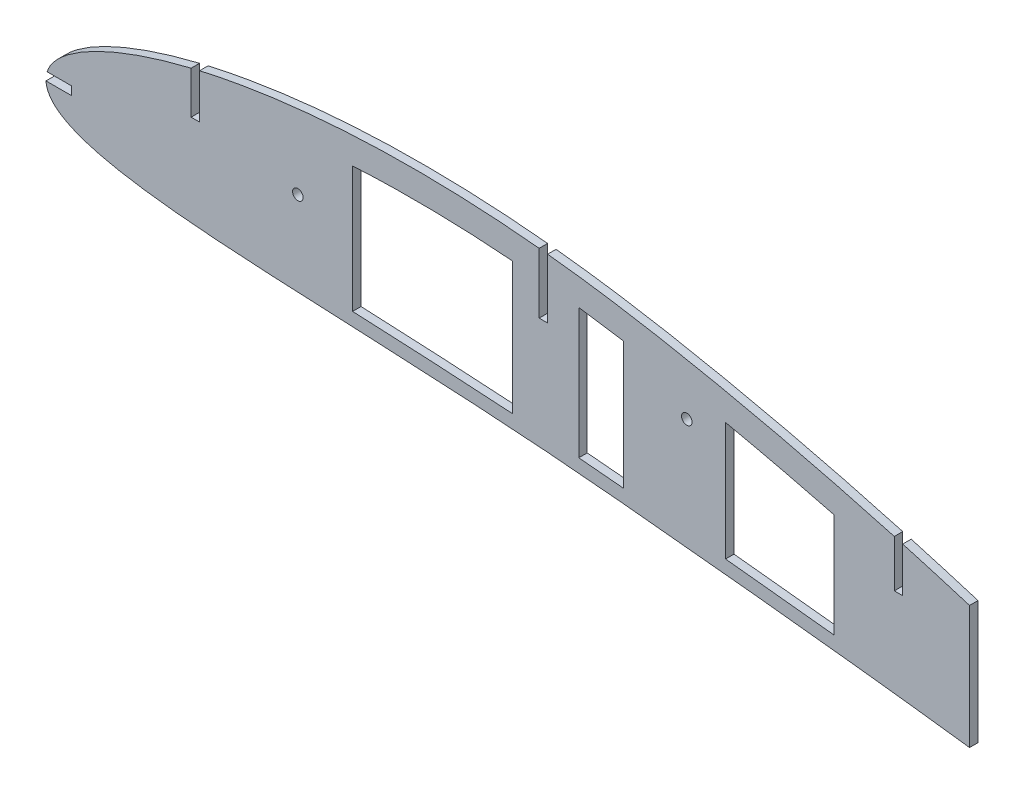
ISO-10303-21;
HEADER;
FILE_DESCRIPTION(('STEP AP214'),'2;1');
FILE_NAME('part.step','',(''),(''),'','','');
FILE_SCHEMA(('AUTOMOTIVE_DESIGN { 1 0 10303 214 1 1 1 1 }'));
ENDSEC;
DATA;
#1=APPLICATION_CONTEXT('core data for automotive mechanical design processes');
#2=APPLICATION_PROTOCOL_DEFINITION('international standard','automotive_design',2000,#1);
#3=PRODUCT_CONTEXT('',#1,'mechanical');
#4=PRODUCT('Part','Part','',(#3));
#5=PRODUCT_RELATED_PRODUCT_CATEGORY('part','',(#4));
#6=PRODUCT_DEFINITION_FORMATION('','',#4);
#7=PRODUCT_DEFINITION_CONTEXT('part definition',#1,'design');
#8=PRODUCT_DEFINITION('design','',#6,#7);
#9=PRODUCT_DEFINITION_SHAPE('','',#8);
#10=(LENGTH_UNIT() NAMED_UNIT(*) SI_UNIT(.MILLI.,.METRE.));
#11=(NAMED_UNIT(*) PLANE_ANGLE_UNIT() SI_UNIT($,.RADIAN.));
#12=(NAMED_UNIT(*) SI_UNIT($,.STERADIAN.) SOLID_ANGLE_UNIT());
#13=UNCERTAINTY_MEASURE_WITH_UNIT(LENGTH_MEASURE(1.E-05),#10,'distance_accuracy_value','');
#14=(GEOMETRIC_REPRESENTATION_CONTEXT(3) GLOBAL_UNCERTAINTY_ASSIGNED_CONTEXT((#13)) GLOBAL_UNIT_ASSIGNED_CONTEXT((#10,
#11,#12)) REPRESENTATION_CONTEXT('',''));
#15=CARTESIAN_POINT('',(0.,0.,0.));
#16=DIRECTION('',(0.,0.,1.));
#17=DIRECTION('',(1.,0.,0.));
#18=AXIS2_PLACEMENT_3D('',#15,#16,#17);
#19=CARTESIAN_POINT('',(533.4,-74.964481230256,476.25));
#20=CARTESIAN_POINT('',(533.393468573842,-74.3592932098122,476.25));
#21=CARTESIAN_POINT('',(531.326375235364,-72.9726299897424,476.25));
#22=CARTESIAN_POINT('',(527.400147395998,-71.2980390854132,476.25));
#23=CARTESIAN_POINT('',(520.602221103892,-67.7648945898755,476.25));
#24=CARTESIAN_POINT('',(511.347792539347,-63.3267299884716,476.25));
#25=CARTESIAN_POINT('',(499.502755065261,-57.6778186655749,476.25));
#26=CARTESIAN_POINT('',(485.246764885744,-51.1384096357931,476.25));
#27=CARTESIAN_POINT('',(468.676978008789,-43.8036364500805,476.25));
#28=CARTESIAN_POINT('',(449.947936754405,-35.8757202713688,476.25));
#29=CARTESIAN_POINT('',(429.230598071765,-27.5332286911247,476.25));
#30=CARTESIAN_POINT('',(406.718257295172,-18.9792879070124,476.25));
#31=CARTESIAN_POINT('',(382.640885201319,-10.382344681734,476.25));
#32=CARTESIAN_POINT('',(357.234331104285,-1.94698223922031,476.25));
#33=CARTESIAN_POINT('',(330.760171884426,6.14483374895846,476.25));
#34=CARTESIAN_POINT('',(303.50010629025,13.7381782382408,476.25));
#35=CARTESIAN_POINT('',(275.749595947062,20.6681404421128,476.25));
#36=CARTESIAN_POINT('',(247.797497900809,26.795319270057,476.25));
#37=CARTESIAN_POINT('',(219.77579834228,32.1343026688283,476.25));
#38=CARTESIAN_POINT('',(191.912986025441,36.1053653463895,476.25));
#39=CARTESIAN_POINT('',(164.569256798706,38.4384325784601,476.25));
#40=CARTESIAN_POINT('',(138.326668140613,39.1929872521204,476.25));
#41=CARTESIAN_POINT('',(113.549606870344,38.4856846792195,476.25));
#42=CARTESIAN_POINT('',(90.5807469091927,36.4479003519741,476.25));
#43=CARTESIAN_POINT('',(69.7330173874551,33.2891377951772,476.25));
#44=CARTESIAN_POINT('',(51.2766476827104,29.241370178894,476.25));
#45=CARTESIAN_POINT('',(35.4362610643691,24.539415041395,476.25));
#46=CARTESIAN_POINT('',(22.3884874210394,19.4234784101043,476.25));
#47=CARTESIAN_POINT('',(12.2196962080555,14.1253370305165,476.25));
#48=CARTESIAN_POINT('',(4.99901469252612,8.78084818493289,476.25));
#49=CARTESIAN_POINT('',(0.528637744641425,3.39704674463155,476.25));
#50=CARTESIAN_POINT('',(-0.609774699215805,-2.47889500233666,476.25));
#51=CARTESIAN_POINT('',(2.2546949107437,-7.70032156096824,476.25));
#52=CARTESIAN_POINT('',(8.00374597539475,-11.5081485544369,476.25));
#53=CARTESIAN_POINT('',(16.1982900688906,-14.6095937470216,476.25));
#54=CARTESIAN_POINT('',(26.9584985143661,-17.1149449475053,476.25));
#55=CARTESIAN_POINT('',(40.1607249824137,-19.119889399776,476.25));
#56=CARTESIAN_POINT('',(55.6666229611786,-20.6931815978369,476.25));
#57=CARTESIAN_POINT('',(73.2848054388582,-21.9411220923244,476.25));
#58=CARTESIAN_POINT('',(92.8177540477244,-22.9728124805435,476.25));
#59=CARTESIAN_POINT('',(114.052803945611,-23.9452202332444,476.25));
#60=CARTESIAN_POINT('',(136.779007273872,-24.9935512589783,476.25));
#61=CARTESIAN_POINT('',(160.778166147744,-26.2653553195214,476.25));
#62=CARTESIAN_POINT('',(185.828467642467,-27.915792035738,476.25));
#63=CARTESIAN_POINT('',(211.89529547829,-30.1378921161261,476.25));
#64=CARTESIAN_POINT('',(238.754061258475,-32.8568494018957,476.25));
#65=CARTESIAN_POINT('',(266.18062536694,-35.6241165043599,476.25));
#66=CARTESIAN_POINT('',(293.670265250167,-38.5940579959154,476.25));
#67=CARTESIAN_POINT('',(320.914949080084,-41.7432849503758,476.25));
#68=CARTESIAN_POINT('',(347.620557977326,-45.0642539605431,476.25));
#69=CARTESIAN_POINT('',(373.491842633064,-48.5288730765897,476.25));
#70=CARTESIAN_POINT('',(398.242667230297,-52.0819020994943,476.25));
#71=CARTESIAN_POINT('',(421.599418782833,-55.6440146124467,476.25));
#72=CARTESIAN_POINT('',(443.29349060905,-59.1670522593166,476.25));
#73=CARTESIAN_POINT('',(463.083690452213,-62.5183563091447,476.25));
#74=CARTESIAN_POINT('',(480.742383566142,-65.6572438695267,476.25));
#75=CARTESIAN_POINT('',(496.042405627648,-68.4378938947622,476.25));
#76=CARTESIAN_POINT('',(508.873832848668,-70.9319094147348,476.25));
#77=CARTESIAN_POINT('',(518.888745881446,-72.641498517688,476.25));
#78=CARTESIAN_POINT('',(526.44030087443,-74.6129246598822,476.25));
#79=CARTESIAN_POINT('',(530.448180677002,-74.5383148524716,476.25));
#80=CARTESIAN_POINT('',(533.132177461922,-76.0695207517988,476.25));
#81=CARTESIAN_POINT('',(533.402547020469,-75.2004827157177,476.25));
#82=CARTESIAN_POINT('',(533.4,-74.964481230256,476.25));
#83=B_SPLINE_CURVE_WITH_KNOTS('',3,(#19,#20,#21,#22,#23,#24,#25,#26,#27,#28,#29,#30,#31,#32,#33,
#34,#35,#36,#37,#38,#39,#40,#41,#42,#43,#44,#45,#46,#47,#48,#49,#50,#51,#52,#53,#54,#55,#56,#57,
#58,#59,#60,#61,#62,#63,#64,#65,#66,#67,#68,#69,#70,#71,#72,#73,#74,#75,#76,#77,#78,#79,#80,#81,
#82),.UNSPECIFIED.,.T.,.F.,(4,1,1,1,1,1,1,1,1,1,1,1,1,1,1,1,1,1,1,1,1,1,1,1,1,1,1,1,1,1,1,1,1,1,
1,1,1,1,1,1,1,1,1,1,1,1,1,1,1,1,1,1,1,1,1,1,1,1,1,1,1,4),(0.,0.00157509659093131,
0.00566746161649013,0.0124361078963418,0.0218013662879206,0.0336583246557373,0.0478653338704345,
0.0642720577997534,0.0826832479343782,0.102902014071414,0.124705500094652,0.147849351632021,
0.17208133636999,0.197142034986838,0.222755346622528,0.248649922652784,0.274532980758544,
0.300183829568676,0.325827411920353,0.35065745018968,0.37440722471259,0.396834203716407,
0.417695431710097,0.436768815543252,0.45385571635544,0.46878827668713,0.481435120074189,
0.491734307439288,0.499717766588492,0.505647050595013,0.510284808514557,0.51492307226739,
0.520799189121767,0.528612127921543,0.538559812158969,0.550634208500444,0.564731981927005,
0.580723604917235,0.598426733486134,0.617662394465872,0.638248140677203,0.659991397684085,
0.682696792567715,0.70618055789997,0.730782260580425,0.755750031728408,0.780776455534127,
0.805604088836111,0.829967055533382,0.853600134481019,0.876238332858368,0.897630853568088,
0.917536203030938,0.935711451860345,0.951952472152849,0.966054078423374,0.977844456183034,
0.987176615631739,0.993932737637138,0.998018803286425,0.999385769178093,1.),.UNSPECIFIED.);
#84=DIRECTION('',(0.,0.,-1.));
#85=VECTOR('',#84,1.);
#86=SURFACE_OF_LINEAR_EXTRUSION('',#83,#85);
#87=CARTESIAN_POINT('',(533.4,-74.964481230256,243.125));
#88=CARTESIAN_POINT('',(533.393468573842,-74.3592932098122,243.125));
#89=CARTESIAN_POINT('',(531.326375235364,-72.9726299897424,243.125));
#90=CARTESIAN_POINT('',(527.400147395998,-71.2980390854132,243.125));
#91=CARTESIAN_POINT('',(520.602221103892,-67.7648945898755,243.125));
#92=CARTESIAN_POINT('',(511.347792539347,-63.3267299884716,243.125));
#93=CARTESIAN_POINT('',(499.502755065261,-57.6778186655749,243.125));
#94=CARTESIAN_POINT('',(485.246764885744,-51.1384096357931,243.125));
#95=CARTESIAN_POINT('',(468.676978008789,-43.8036364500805,243.125));
#96=CARTESIAN_POINT('',(449.947936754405,-35.8757202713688,243.125));
#97=CARTESIAN_POINT('',(429.230598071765,-27.5332286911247,243.125));
#98=CARTESIAN_POINT('',(406.718257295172,-18.9792879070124,243.125));
#99=CARTESIAN_POINT('',(382.640885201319,-10.382344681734,243.125));
#100=CARTESIAN_POINT('',(357.234331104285,-1.94698223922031,243.125));
#101=CARTESIAN_POINT('',(330.760171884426,6.14483374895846,243.125));
#102=CARTESIAN_POINT('',(303.50010629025,13.7381782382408,243.125));
#103=CARTESIAN_POINT('',(275.749595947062,20.6681404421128,243.125));
#104=CARTESIAN_POINT('',(247.797497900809,26.795319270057,243.125));
#105=CARTESIAN_POINT('',(219.77579834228,32.1343026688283,243.125));
#106=CARTESIAN_POINT('',(191.912986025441,36.1053653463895,243.125));
#107=CARTESIAN_POINT('',(164.569256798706,38.4384325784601,243.125));
#108=CARTESIAN_POINT('',(138.326668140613,39.1929872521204,243.125));
#109=CARTESIAN_POINT('',(113.549606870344,38.4856846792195,243.125));
#110=CARTESIAN_POINT('',(90.5807469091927,36.4479003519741,243.125));
#111=CARTESIAN_POINT('',(69.7330173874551,33.2891377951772,243.125));
#112=CARTESIAN_POINT('',(51.2766476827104,29.241370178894,243.125));
#113=CARTESIAN_POINT('',(35.4362610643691,24.539415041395,243.125));
#114=CARTESIAN_POINT('',(22.3884874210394,19.4234784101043,243.125));
#115=CARTESIAN_POINT('',(12.2196962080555,14.1253370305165,243.125));
#116=CARTESIAN_POINT('',(4.99901469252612,8.78084818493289,243.125));
#117=CARTESIAN_POINT('',(0.528637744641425,3.39704674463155,243.125));
#118=CARTESIAN_POINT('',(-0.609774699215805,-2.47889500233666,243.125));
#119=CARTESIAN_POINT('',(2.2546949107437,-7.70032156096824,243.125));
#120=CARTESIAN_POINT('',(8.00374597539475,-11.5081485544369,243.125));
#121=CARTESIAN_POINT('',(16.1982900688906,-14.6095937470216,243.125));
#122=CARTESIAN_POINT('',(26.9584985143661,-17.1149449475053,243.125));
#123=CARTESIAN_POINT('',(40.1607249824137,-19.119889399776,243.125));
#124=CARTESIAN_POINT('',(55.6666229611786,-20.6931815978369,243.125));
#125=CARTESIAN_POINT('',(73.2848054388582,-21.9411220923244,243.125));
#126=CARTESIAN_POINT('',(92.8177540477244,-22.9728124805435,243.125));
#127=CARTESIAN_POINT('',(114.052803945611,-23.9452202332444,243.125));
#128=CARTESIAN_POINT('',(136.779007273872,-24.9935512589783,243.125));
#129=CARTESIAN_POINT('',(160.778166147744,-26.2653553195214,243.125));
#130=CARTESIAN_POINT('',(185.828467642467,-27.915792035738,243.125));
#131=CARTESIAN_POINT('',(211.89529547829,-30.1378921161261,243.125));
#132=CARTESIAN_POINT('',(238.754061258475,-32.8568494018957,243.125));
#133=CARTESIAN_POINT('',(266.18062536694,-35.6241165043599,243.125));
#134=CARTESIAN_POINT('',(293.670265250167,-38.5940579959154,243.125));
#135=CARTESIAN_POINT('',(320.914949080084,-41.7432849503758,243.125));
#136=CARTESIAN_POINT('',(347.620557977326,-45.0642539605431,243.125));
#137=CARTESIAN_POINT('',(373.491842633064,-48.5288730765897,243.125));
#138=CARTESIAN_POINT('',(398.242667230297,-52.0819020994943,243.125));
#139=CARTESIAN_POINT('',(421.599418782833,-55.6440146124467,243.125));
#140=CARTESIAN_POINT('',(443.29349060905,-59.1670522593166,243.125));
#141=CARTESIAN_POINT('',(463.083690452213,-62.5183563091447,243.125));
#142=CARTESIAN_POINT('',(480.742383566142,-65.6572438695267,243.125));
#143=CARTESIAN_POINT('',(496.042405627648,-68.4378938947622,243.125));
#144=CARTESIAN_POINT('',(508.873832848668,-70.9319094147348,243.125));
#145=CARTESIAN_POINT('',(518.888745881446,-72.641498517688,243.125));
#146=CARTESIAN_POINT('',(526.44030087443,-74.6129246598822,243.125));
#147=CARTESIAN_POINT('',(530.448180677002,-74.5383148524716,243.125));
#148=CARTESIAN_POINT('',(533.132177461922,-76.0695207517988,243.125));
#149=CARTESIAN_POINT('',(533.402547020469,-75.2004827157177,243.125));
#150=CARTESIAN_POINT('',(533.4,-74.964481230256,243.125));
#151=B_SPLINE_CURVE_WITH_KNOTS('',3,(#87,#88,#89,#90,#91,#92,#93,#94,#95,#96,#97,#98,#99,#100,
#101,#102,#103,#104,#105,#106,#107,#108,#109,#110,#111,#112,#113,#114,#115,#116,#117,#118,#119,
#120,#121,#122,#123,#124,#125,#126,#127,#128,#129,#130,#131,#132,#133,#134,#135,#136,#137,#138,
#139,#140,#141,#142,#143,#144,#145,#146,#147,#148,#149,#150),.UNSPECIFIED.,.T.,.F.,(4,1,1,1,1,1,
1,1,1,1,1,1,1,1,1,1,1,1,1,1,1,1,1,1,1,1,1,1,1,1,1,1,1,1,1,1,1,1,1,1,1,1,1,1,1,1,1,1,1,1,1,1,1,1,
1,1,1,1,1,1,1,4),(0.,0.00157509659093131,0.00566746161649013,0.0124361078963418,
0.0218013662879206,0.0336583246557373,0.0478653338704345,0.0642720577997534,0.0826832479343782,
0.102902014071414,0.124705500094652,0.147849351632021,0.17208133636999,0.197142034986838,
0.222755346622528,0.248649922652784,0.274532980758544,0.300183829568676,0.325827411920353,
0.35065745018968,0.37440722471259,0.396834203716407,0.417695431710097,0.436768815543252,
0.45385571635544,0.46878827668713,0.481435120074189,0.491734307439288,0.499717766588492,
0.505647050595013,0.510284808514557,0.51492307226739,0.520799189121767,0.528612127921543,
0.538559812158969,0.550634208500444,0.564731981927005,0.580723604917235,0.598426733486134,
0.617662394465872,0.638248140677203,0.659991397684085,0.682696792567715,0.70618055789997,
0.730782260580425,0.755750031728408,0.780776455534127,0.805604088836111,0.829967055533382,
0.853600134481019,0.876238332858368,0.897630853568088,0.917536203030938,0.935711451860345,
0.951952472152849,0.966054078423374,0.977844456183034,0.987176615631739,0.993932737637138,
0.998018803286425,0.999385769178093,1.),.UNSPECIFIED.);
#152=CARTESIAN_POINT('',(-0.0777929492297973,-1.5875,243.125));
#153=VERTEX_POINT('',#152);
#154=CARTESIAN_POINT('',(346.71,-44.9888969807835,243.125000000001));
#155=VERTEX_POINT('',#154);
#156=EDGE_CURVE('E527',#153,#155,#151,.T.);
#157=ORIENTED_EDGE('',*,*,#156,.F.);
#158=DIRECTION('',(0.,0.,-1.));
#159=VECTOR('',#158,1.);
#160=CARTESIAN_POINT('',(-0.077792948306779,-1.58750000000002,241.5375));
#161=LINE('',#160,#159);
#162=CARTESIAN_POINT('',(-0.077792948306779,-1.58750000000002,239.95));
#163=VERTEX_POINT('',#162);
#164=EDGE_CURVE('E59',#153,#163,#161,.T.);
#165=ORIENTED_EDGE('',*,*,#164,.T.);
#166=CARTESIAN_POINT('',(533.4,-74.964481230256,239.95));
#167=CARTESIAN_POINT('',(533.393468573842,-74.3592932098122,239.95));
#168=CARTESIAN_POINT('',(531.326375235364,-72.9726299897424,239.95));
#169=CARTESIAN_POINT('',(527.400147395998,-71.2980390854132,239.95));
#170=CARTESIAN_POINT('',(520.602221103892,-67.7648945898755,239.95));
#171=CARTESIAN_POINT('',(511.347792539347,-63.3267299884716,239.95));
#172=CARTESIAN_POINT('',(499.502755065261,-57.6778186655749,239.95));
#173=CARTESIAN_POINT('',(485.246764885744,-51.1384096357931,239.95));
#174=CARTESIAN_POINT('',(468.676978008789,-43.8036364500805,239.95));
#175=CARTESIAN_POINT('',(449.947936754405,-35.8757202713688,239.95));
#176=CARTESIAN_POINT('',(429.230598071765,-27.5332286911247,239.95));
#177=CARTESIAN_POINT('',(406.718257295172,-18.9792879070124,239.95));
#178=CARTESIAN_POINT('',(382.640885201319,-10.382344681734,239.95));
#179=CARTESIAN_POINT('',(357.234331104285,-1.94698223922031,239.95));
#180=CARTESIAN_POINT('',(330.760171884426,6.14483374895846,239.95));
#181=CARTESIAN_POINT('',(303.50010629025,13.7381782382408,239.95));
#182=CARTESIAN_POINT('',(275.749595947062,20.6681404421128,239.95));
#183=CARTESIAN_POINT('',(247.797497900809,26.795319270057,239.95));
#184=CARTESIAN_POINT('',(219.77579834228,32.1343026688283,239.95));
#185=CARTESIAN_POINT('',(191.912986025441,36.1053653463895,239.95));
#186=CARTESIAN_POINT('',(164.569256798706,38.4384325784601,239.95));
#187=CARTESIAN_POINT('',(138.326668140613,39.1929872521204,239.95));
#188=CARTESIAN_POINT('',(113.549606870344,38.4856846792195,239.95));
#189=CARTESIAN_POINT('',(90.5807469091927,36.4479003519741,239.95));
#190=CARTESIAN_POINT('',(69.7330173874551,33.2891377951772,239.95));
#191=CARTESIAN_POINT('',(51.2766476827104,29.241370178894,239.95));
#192=CARTESIAN_POINT('',(35.4362610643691,24.539415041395,239.95));
#193=CARTESIAN_POINT('',(22.3884874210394,19.4234784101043,239.95));
#194=CARTESIAN_POINT('',(12.2196962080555,14.1253370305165,239.95));
#195=CARTESIAN_POINT('',(4.99901469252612,8.78084818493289,239.95));
#196=CARTESIAN_POINT('',(0.528637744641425,3.39704674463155,239.95));
#197=CARTESIAN_POINT('',(-0.609774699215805,-2.47889500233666,239.95));
#198=CARTESIAN_POINT('',(2.2546949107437,-7.70032156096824,239.95));
#199=CARTESIAN_POINT('',(8.00374597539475,-11.5081485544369,239.95));
#200=CARTESIAN_POINT('',(16.1982900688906,-14.6095937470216,239.95));
#201=CARTESIAN_POINT('',(26.9584985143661,-17.1149449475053,239.95));
#202=CARTESIAN_POINT('',(40.1607249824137,-19.119889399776,239.95));
#203=CARTESIAN_POINT('',(55.6666229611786,-20.6931815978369,239.95));
#204=CARTESIAN_POINT('',(73.2848054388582,-21.9411220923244,239.95));
#205=CARTESIAN_POINT('',(92.8177540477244,-22.9728124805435,239.95));
#206=CARTESIAN_POINT('',(114.052803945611,-23.9452202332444,239.95));
#207=CARTESIAN_POINT('',(136.779007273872,-24.9935512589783,239.95));
#208=CARTESIAN_POINT('',(160.778166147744,-26.2653553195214,239.95));
#209=CARTESIAN_POINT('',(185.828467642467,-27.915792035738,239.95));
#210=CARTESIAN_POINT('',(211.89529547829,-30.1378921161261,239.95));
#211=CARTESIAN_POINT('',(238.754061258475,-32.8568494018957,239.95));
#212=CARTESIAN_POINT('',(266.18062536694,-35.6241165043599,239.95));
#213=CARTESIAN_POINT('',(293.670265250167,-38.5940579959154,239.95));
#214=CARTESIAN_POINT('',(320.914949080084,-41.7432849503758,239.95));
#215=CARTESIAN_POINT('',(347.620557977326,-45.0642539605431,239.95));
#216=CARTESIAN_POINT('',(373.491842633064,-48.5288730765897,239.95));
#217=CARTESIAN_POINT('',(398.242667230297,-52.0819020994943,239.95));
#218=CARTESIAN_POINT('',(421.599418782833,-55.6440146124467,239.95));
#219=CARTESIAN_POINT('',(443.29349060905,-59.1670522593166,239.95));
#220=CARTESIAN_POINT('',(463.083690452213,-62.5183563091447,239.95));
#221=CARTESIAN_POINT('',(480.742383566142,-65.6572438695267,239.95));
#222=CARTESIAN_POINT('',(496.042405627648,-68.4378938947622,239.95));
#223=CARTESIAN_POINT('',(508.873832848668,-70.9319094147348,239.95));
#224=CARTESIAN_POINT('',(518.888745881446,-72.641498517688,239.95));
#225=CARTESIAN_POINT('',(526.44030087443,-74.6129246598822,239.95));
#226=CARTESIAN_POINT('',(530.448180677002,-74.5383148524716,239.95));
#227=CARTESIAN_POINT('',(533.132177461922,-76.0695207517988,239.95));
#228=CARTESIAN_POINT('',(533.402547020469,-75.2004827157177,239.95));
#229=CARTESIAN_POINT('',(533.4,-74.964481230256,239.95));
#230=B_SPLINE_CURVE_WITH_KNOTS('',3,(#166,#167,#168,#169,#170,#171,#172,#173,#174,#175,#176,
#177,#178,#179,#180,#181,#182,#183,#184,#185,#186,#187,#188,#189,#190,#191,#192,#193,#194,#195,
#196,#197,#198,#199,#200,#201,#202,#203,#204,#205,#206,#207,#208,#209,#210,#211,#212,#213,#214,
#215,#216,#217,#218,#219,#220,#221,#222,#223,#224,#225,#226,#227,#228,#229),.UNSPECIFIED.,.T.,
.F.,(4,1,1,1,1,1,1,1,1,1,1,1,1,1,1,1,1,1,1,1,1,1,1,1,1,1,1,1,1,1,1,1,1,1,1,1,1,1,1,1,1,1,1,1,1,
1,1,1,1,1,1,1,1,1,1,1,1,1,1,1,1,4),(0.,0.00157509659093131,0.00566746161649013,
0.0124361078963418,0.0218013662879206,0.0336583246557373,0.0478653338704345,0.0642720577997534,
0.0826832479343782,0.102902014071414,0.124705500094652,0.147849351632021,0.17208133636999,
0.197142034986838,0.222755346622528,0.248649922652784,0.274532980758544,0.300183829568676,
0.325827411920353,0.35065745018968,0.37440722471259,0.396834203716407,0.417695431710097,
0.436768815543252,0.45385571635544,0.46878827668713,0.481435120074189,0.491734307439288,
0.499717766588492,0.505647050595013,0.510284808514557,0.51492307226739,0.520799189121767,
0.528612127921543,0.538559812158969,0.550634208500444,0.564731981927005,0.580723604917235,
0.598426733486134,0.617662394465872,0.638248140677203,0.659991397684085,0.682696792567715,
0.70618055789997,0.730782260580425,0.755750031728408,0.780776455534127,0.805604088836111,
0.829967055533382,0.853600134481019,0.876238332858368,0.897630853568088,0.917536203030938,
0.935711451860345,0.951952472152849,0.966054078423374,0.977844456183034,0.987176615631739,
0.993932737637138,0.998018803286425,0.999385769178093,1.),.UNSPECIFIED.);
#231=CARTESIAN_POINT('',(346.71,-44.9888969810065,239.95));
#232=VERTEX_POINT('',#231);
#233=EDGE_CURVE('E651',#232,#163,#230,.F.);
#234=ORIENTED_EDGE('',*,*,#233,.F.);
#235=DIRECTION('',(0.,0.,-1.));
#236=VECTOR('',#235,1.);
#237=CARTESIAN_POINT('',(346.71,-44.9888969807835,240.625));
#238=LINE('',#237,#236);
#239=EDGE_CURVE('E716',#155,#232,#238,.T.);
#240=ORIENTED_EDGE('',*,*,#239,.F.);
#241=EDGE_LOOP('',(#157,#165,#234,#240));
#242=FACE_BOUND('',#241,.T.);
#243=ADVANCED_FACE('F49',(#242),#86,.F.);
#244=CARTESIAN_POINT('',(4.42497203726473,7.78722275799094,243.125));
#245=DIRECTION('',(0.,0.,-1.));
#246=DIRECTION('',(-1.,0.,0.));
#247=AXIS2_PLACEMENT_3D('',#244,#245,#246);
#248=PLANE('',#247);
#249=DIRECTION('',(0.,-1.,0.));
#250=VECTOR('',#249,1.);
#251=CARTESIAN_POINT('',(295.885402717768,0.,243.125));
#252=LINE('',#251,#250);
#253=CARTESIAN_POINT('',(295.885402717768,5.26018954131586,243.125));
#254=VERTEX_POINT('',#253);
#255=CARTESIAN_POINT('',(295.885402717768,-33.8455210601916,243.125));
#256=VERTEX_POINT('',#255);
#257=EDGE_CURVE('E285',#254,#256,#252,.T.);
#258=ORIENTED_EDGE('',*,*,#257,.T.);
#259=CARTESIAN_POINT('',(255.083501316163,-29.485381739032,243.125));
#260=CARTESIAN_POINT('',(259.740207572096,-29.9609707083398,243.125));
#261=CARTESIAN_POINT('',(264.397895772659,-30.4413432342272,243.125));
#262=CARTESIAN_POINT('',(277.763934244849,-31.8458476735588,243.125));
#263=CARTESIAN_POINT('',(286.469367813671,-32.7902003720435,243.125));
#264=CARTESIAN_POINT('',(295.409625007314,-33.7921299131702,243.125));
#265=CARTESIAN_POINT('',(295.647514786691,-33.8188137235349,243.125));
#266=CARTESIAN_POINT('',(295.885402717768,-33.8455210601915,243.125));
#267=B_SPLINE_CURVE_WITH_KNOTS('',3,(#259,#260,#261,#262,#263,#264,#265,#266),.UNSPECIFIED.,.F.,
.F.,(4,2,2,4),(0.77907005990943,0.8125,0.875,0.876708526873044),.UNSPECIFIED.);
#268=CARTESIAN_POINT('',(255.083501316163,-29.485381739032,243.125));
#269=VERTEX_POINT('',#268);
#270=EDGE_CURVE('E366',#269,#256,#267,.T.);
#271=ORIENTED_EDGE('',*,*,#270,.F.);
#272=DIRECTION('',(0.,-1.,0.));
#273=VECTOR('',#272,1.);
#274=CARTESIAN_POINT('',(255.083501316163,0.,243.125));
#275=LINE('',#274,#273);
#276=CARTESIAN_POINT('',(255.083501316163,14.9161105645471,243.125));
#277=VERTEX_POINT('',#276);
#278=EDGE_CURVE('E379',#277,#269,#275,.T.);
#279=ORIENTED_EDGE('',*,*,#278,.F.);
#280=CARTESIAN_POINT('',(295.885402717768,5.26018954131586,243.125));
#281=CARTESIAN_POINT('',(291.896936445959,6.29213010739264,243.125));
#282=CARTESIAN_POINT('',(287.902858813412,7.30013473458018,243.125));
#283=CARTESIAN_POINT('',(274.329260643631,10.6374053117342,243.125));
#284=CARTESIAN_POINT('',(264.72342374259,12.8472029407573,243.125));
#285=CARTESIAN_POINT('',(255.083501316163,14.9161105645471,243.125));
#286=B_SPLINE_CURVE_WITH_KNOTS('',3,(#280,#281,#282,#283,#284,#285),.UNSPECIFIED.,.F.,.F.,(4,2,
4),(0.156190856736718,0.25,0.474560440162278),.UNSPECIFIED.);
#287=EDGE_CURVE('E376',#254,#277,#286,.T.);
#288=ORIENTED_EDGE('',*,*,#287,.F.);
#289=EDGE_LOOP('',(#258,#271,#279,#288));
#290=FACE_BOUND('',#289,.T.);
#291=CARTESIAN_POINT('',(115.041582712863,-18.9866491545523,243.125));
#292=CARTESIAN_POINT('',(122.715194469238,-19.3395510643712,243.125));
#293=CARTESIAN_POINT('',(130.394601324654,-19.6953332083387,243.125));
#294=CARTESIAN_POINT('',(146.824988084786,-20.5153763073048,243.125));
#295=CARTESIAN_POINT('',(155.576251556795,-20.9873571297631,243.125));
#296=CARTESIAN_POINT('',(167.903318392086,-21.7423428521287,243.125));
#297=CARTESIAN_POINT('',(171.478087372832,-21.9721436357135,243.125));
#298=CARTESIAN_POINT('',(175.052736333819,-22.2144233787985,243.125));
#299=B_SPLINE_CURVE_WITH_KNOTS('',3,(#291,#292,#293,#294,#295,#296,#297,#298),.UNSPECIFIED.,.F.,
.F.,(4,2,2,4),(0.445105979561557,0.500000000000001,0.562500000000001,0.588021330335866),.UNSPECIFIED.);
#300=CARTESIAN_POINT('',(115.041582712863,-18.9866491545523,243.125));
#301=VERTEX_POINT('',#300);
#302=CARTESIAN_POINT('',(175.052736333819,-22.2144233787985,243.125));
#303=VERTEX_POINT('',#302);
#304=EDGE_CURVE('E588',#301,#303,#299,.T.);
#305=ORIENTED_EDGE('',*,*,#304,.F.);
#306=DIRECTION('',(0.,-1.,0.));
#307=VECTOR('',#306,1.);
#308=CARTESIAN_POINT('',(115.041582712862,3.54400515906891E-12,243.125));
#309=LINE('',#308,#307);
#310=CARTESIAN_POINT('',(115.041582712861,28.3143205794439,243.125));
#311=VERTEX_POINT('',#310);
#312=EDGE_CURVE('E865',#311,#301,#309,.T.);
#313=ORIENTED_EDGE('',*,*,#312,.F.);
#314=CARTESIAN_POINT('',(175.052736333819,27.437925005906,243.125));
#315=CARTESIAN_POINT('',(167.64436416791,28.0370437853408,243.125));
#316=CARTESIAN_POINT('',(160.224444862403,28.4621916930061,243.125));
#317=CARTESIAN_POINT('',(142.356458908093,29.0497297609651,243.125));
#318=CARTESIAN_POINT('',(131.904498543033,29.0355302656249,243.125));
#319=CARTESIAN_POINT('',(119.337636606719,28.5367681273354,243.125));
#320=CARTESIAN_POINT('',(117.188708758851,28.4343457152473,243.125));
#321=CARTESIAN_POINT('',(115.041582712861,28.3143205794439,243.125));
#322=B_SPLINE_CURVE_WITH_KNOTS('',3,(#314,#315,#316,#317,#318,#319,#320,#321),.UNSPECIFIED.,.F.,
.F.,(4,2,2,4),(0.0724048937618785,0.25,0.5,0.551607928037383),.UNSPECIFIED.);
#323=CARTESIAN_POINT('',(175.052736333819,27.437925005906,243.125));
#324=VERTEX_POINT('',#323);
#325=EDGE_CURVE('E802',#324,#311,#322,.T.);
#326=ORIENTED_EDGE('',*,*,#325,.F.);
#327=DIRECTION('',(0.,-1.,0.));
#328=VECTOR('',#327,1.);
#329=CARTESIAN_POINT('',(175.052736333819,5.87125034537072E-13,243.125));
#330=LINE('',#329,#328);
#331=EDGE_CURVE('E810',#324,#303,#330,.T.);
#332=ORIENTED_EDGE('',*,*,#331,.T.);
#333=EDGE_LOOP('',(#305,#313,#326,#332));
#334=FACE_BOUND('',#333,.T.);
#335=CARTESIAN_POINT('',(94.488,8.72347895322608,243.125));
#336=DIRECTION('',(0.,0.,-1.));
#337=DIRECTION('',(-1.,0.,0.));
#338=AXIS2_PLACEMENT_3D('',#335,#336,#337);
#339=CIRCLE('',#338,1.9812);
#340=CARTESIAN_POINT('',(92.5068,8.72347895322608,243.125));
#341=VERTEX_POINT('',#340);
#342=EDGE_CURVE('E493',#341,#341,#339,.F.);
#343=ORIENTED_EDGE('',*,*,#342,.F.);
#344=EDGE_LOOP('',(#343));
#345=FACE_BOUND('',#344,.T.);
#346=DIRECTION('',(0.,1.,0.));
#347=VECTOR('',#346,1.);
#348=CARTESIAN_POINT('',(9.52500000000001,-1.5875,243.125));
#349=LINE('',#348,#347);
#350=CARTESIAN_POINT('',(9.52500000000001,-1.5875,243.125));
#351=VERTEX_POINT('',#350);
#352=CARTESIAN_POINT('',(9.52500000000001,1.5875,243.125));
#353=VERTEX_POINT('',#352);
#354=EDGE_CURVE('E258',#351,#353,#349,.T.);
#355=ORIENTED_EDGE('',*,*,#354,.F.);
#356=DIRECTION('',(1.,0.,0.));
#357=VECTOR('',#356,1.);
#358=CARTESIAN_POINT('',(-9.525,-1.5875,243.125));
#359=LINE('',#358,#357);
#360=EDGE_CURVE('E255',#153,#351,#359,.T.);
#361=ORIENTED_EDGE('',*,*,#360,.F.);
#362=ORIENTED_EDGE('',*,*,#156,.T.);
#363=DIRECTION('',(0.,-1.,0.));
#364=VECTOR('',#363,1.);
#365=CARTESIAN_POINT('',(346.71,7.78722275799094,243.125));
#366=LINE('',#365,#364);
#367=CARTESIAN_POINT('',(346.71,1.23712825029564,243.125));
#368=VERTEX_POINT('',#367);
#369=EDGE_CURVE('E719',#368,#155,#366,.T.);
#370=ORIENTED_EDGE('',*,*,#369,.F.);
#371=CARTESIAN_POINT('',(321.627500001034,8.64800941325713,243.125));
#372=VERTEX_POINT('',#371);
#373=EDGE_CURVE('E548',#368,#372,#151,.T.);
#374=ORIENTED_EDGE('',*,*,#373,.T.);
#375=DIRECTION('',(0.,-1.,0.));
#376=VECTOR('',#375,1.);
#377=CARTESIAN_POINT('',(321.627499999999,7.7872227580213,243.125));
#378=LINE('',#377,#376);
#379=CARTESIAN_POINT('',(321.6275,-8.16744704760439,243.125));
#380=VERTEX_POINT('',#379);
#381=EDGE_CURVE('E506',#372,#380,#378,.T.);
#382=ORIENTED_EDGE('',*,*,#381,.T.);
#383=DIRECTION('',(-1.,0.,0.));
#384=VECTOR('',#383,1.);
#385=CARTESIAN_POINT('',(4.42497203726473,-8.16744704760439,243.125));
#386=LINE('',#385,#384);
#387=CARTESIAN_POINT('',(318.4525,-8.16744704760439,243.125));
#388=VERTEX_POINT('',#387);
#389=EDGE_CURVE('E514',#380,#388,#386,.T.);
#390=ORIENTED_EDGE('',*,*,#389,.T.);
#391=DIRECTION('',(0.,1.,0.));
#392=VECTOR('',#391,1.);
#393=CARTESIAN_POINT('',(318.452499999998,7.78722275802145,243.125));
#394=LINE('',#393,#392);
#395=CARTESIAN_POINT('',(318.452499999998,9.54073651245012,243.125));
#396=VERTEX_POINT('',#395);
#397=EDGE_CURVE('E510',#388,#396,#394,.T.);
#398=ORIENTED_EDGE('',*,*,#397,.T.);
#399=CARTESIAN_POINT('',(188.277499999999,36.2413167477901,243.125));
#400=VERTEX_POINT('',#399);
#401=EDGE_CURVE('E532',#396,#400,#151,.T.);
#402=ORIENTED_EDGE('',*,*,#401,.T.);
#403=DIRECTION('',(0.,-1.,0.));
#404=VECTOR('',#403,1.);
#405=CARTESIAN_POINT('',(188.2775,7.78722275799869,243.125));
#406=LINE('',#405,#404);
#407=CARTESIAN_POINT('',(188.2775,13.8593727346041,243.125));
#408=VERTEX_POINT('',#407);
#409=EDGE_CURVE('E502',#400,#408,#406,.T.);
#410=ORIENTED_EDGE('',*,*,#409,.T.);
#411=DIRECTION('',(-1.,0.,0.));
#412=VECTOR('',#411,1.);
#413=CARTESIAN_POINT('',(4.42497203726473,13.8593727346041,243.125));
#414=LINE('',#413,#412);
#415=CARTESIAN_POINT('',(185.1025,13.8593727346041,243.125));
#416=VERTEX_POINT('',#415);
#417=EDGE_CURVE('E498',#408,#416,#414,.T.);
#418=ORIENTED_EDGE('',*,*,#417,.T.);
#419=DIRECTION('',(0.,1.,0.));
#420=VECTOR('',#419,1.);
#421=CARTESIAN_POINT('',(185.1025,7.78722275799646,243.125));
#422=LINE('',#421,#420);
#423=CARTESIAN_POINT('',(185.102499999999,36.5692474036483,243.125));
#424=VERTEX_POINT('',#423);
#425=EDGE_CURVE('E494',#416,#424,#422,.T.);
#426=ORIENTED_EDGE('',*,*,#425,.T.);
#427=CARTESIAN_POINT('',(57.5944999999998,30.5567205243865,243.125));
#428=VERTEX_POINT('',#427);
#429=EDGE_CURVE('E531',#424,#428,#151,.T.);
#430=ORIENTED_EDGE('',*,*,#429,.T.);
#431=DIRECTION('',(0.,-1.,0.));
#432=VECTOR('',#431,1.);
#433=CARTESIAN_POINT('',(57.5945,7.78722275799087,243.125));
#434=LINE('',#433,#432);
#435=CARTESIAN_POINT('',(57.5945,13.8593727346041,243.125));
#436=VERTEX_POINT('',#435);
#437=EDGE_CURVE('E456',#428,#436,#434,.T.);
#438=ORIENTED_EDGE('',*,*,#437,.T.);
#439=DIRECTION('',(-1.,0.,0.));
#440=VECTOR('',#439,1.);
#441=CARTESIAN_POINT('',(4.42497203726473,13.8593727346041,243.125));
#442=LINE('',#441,#440);
#443=CARTESIAN_POINT('',(54.4195,13.8593727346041,243.125));
#444=VERTEX_POINT('',#443);
#445=EDGE_CURVE('E523',#436,#444,#442,.T.);
#446=ORIENTED_EDGE('',*,*,#445,.T.);
#447=DIRECTION('',(0.,1.,0.));
#448=VECTOR('',#447,1.);
#449=CARTESIAN_POINT('',(54.4195,7.78722275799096,243.125));
#450=LINE('',#449,#448);
#451=CARTESIAN_POINT('',(54.4194999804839,29.8052641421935,243.125));
#452=VERTEX_POINT('',#451);
#453=EDGE_CURVE('E520',#444,#452,#450,.T.);
#454=ORIENTED_EDGE('',*,*,#453,.T.);
#455=CARTESIAN_POINT('',(0.358619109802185,1.58750000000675,243.125));
#456=VERTEX_POINT('',#455);
#457=EDGE_CURVE('E271',#452,#456,#151,.T.);
#458=ORIENTED_EDGE('',*,*,#457,.T.);
#459=DIRECTION('',(-1.,0.,0.));
#460=VECTOR('',#459,1.);
#461=CARTESIAN_POINT('',(-9.525,1.5875,243.125));
#462=LINE('',#461,#460);
#463=EDGE_CURVE('E66',#353,#456,#462,.T.);
#464=ORIENTED_EDGE('',*,*,#463,.F.);
#465=EDGE_LOOP('',(#355,#361,#362,#370,#374,#382,#390,#398,#402,#410,#418,#426,#430,#438,#446,
#454,#458,#464));
#466=FACE_BOUND('',#465,.T.);
#467=CARTESIAN_POINT('',(240.538,8.7234789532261,243.125));
#468=DIRECTION('',(0.,0.,1.));
#469=DIRECTION('',(1.,0.,0.));
#470=AXIS2_PLACEMENT_3D('',#467,#468,#469);
#471=CIRCLE('',#470,1.9812);
#472=CARTESIAN_POINT('',(242.5192,8.7234789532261,243.125));
#473=VERTEX_POINT('',#472);
#474=EDGE_CURVE('E315',#473,#473,#471,.T.);
#475=ORIENTED_EDGE('',*,*,#474,.F.);
#476=EDGE_LOOP('',(#475));
#477=FACE_BOUND('',#476,.T.);
#478=DIRECTION('',(0.,-1.,0.));
#479=VECTOR('',#478,1.);
#480=CARTESIAN_POINT('',(216.841337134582,2.51227196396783E-13,243.125));
#481=LINE('',#480,#479);
#482=CARTESIAN_POINT('',(216.841337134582,22.2593044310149,243.125));
#483=VERTEX_POINT('',#482);
#484=CARTESIAN_POINT('',(216.841337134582,-25.6539487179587,243.125));
#485=VERTEX_POINT('',#484);
#486=EDGE_CURVE('E74',#483,#485,#481,.T.);
#487=ORIENTED_EDGE('',*,*,#486,.T.);
#488=CARTESIAN_POINT('',(199.980995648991,-24.123351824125,243.125));
#489=CARTESIAN_POINT('',(205.594275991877,-24.6032080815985,243.125));
#490=CARTESIAN_POINT('',(211.203240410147,-25.1143590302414,243.125));
#491=CARTESIAN_POINT('',(216.817642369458,-25.651680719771,243.125));
#492=CARTESIAN_POINT('',(216.829489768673,-25.6528146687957,243.125));
#493=CARTESIAN_POINT('',(216.841337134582,-25.6539487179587,243.125));
#494=B_SPLINE_CURVE_WITH_KNOTS('',3,(#488,#489,#490,#491,#492,#493),.UNSPECIFIED.,.F.,.F.,(4,2,
4),(0.647373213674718,0.6875,0.687584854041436),.UNSPECIFIED.);
#495=CARTESIAN_POINT('',(199.980995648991,-24.123351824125,243.125));
#496=VERTEX_POINT('',#495);
#497=EDGE_CURVE('E633',#496,#485,#494,.T.);
#498=ORIENTED_EDGE('',*,*,#497,.F.);
#499=DIRECTION('',(5.4101579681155E-13,-1.,0.));
#500=VECTOR('',#499,1.);
#501=CARTESIAN_POINT('',(199.980995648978,1.08192877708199E-10,243.125));
#502=LINE('',#501,#500);
#503=CARTESIAN_POINT('',(199.980995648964,24.7681291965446,243.125));
#504=VERTEX_POINT('',#503);
#505=EDGE_CURVE('E890',#504,#496,#502,.T.);
#506=ORIENTED_EDGE('',*,*,#505,.F.);
#507=CARTESIAN_POINT('',(216.841337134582,22.2593044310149,243.125));
#508=CARTESIAN_POINT('',(211.227128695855,23.1812817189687,243.125));
#509=CARTESIAN_POINT('',(205.607212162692,24.0211304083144,243.125));
#510=CARTESIAN_POINT('',(199.980995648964,24.7681291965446,243.125));
#511=B_SPLINE_CURVE_WITH_KNOTS('',3,(#507,#508,#509,#510),.UNSPECIFIED.,.F.,.F.,(4,4),
(0.770974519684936,0.901435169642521),.UNSPECIFIED.);
#512=EDGE_CURVE('E894',#483,#504,#511,.T.);
#513=ORIENTED_EDGE('',*,*,#512,.F.);
#514=EDGE_LOOP('',(#487,#498,#506,#513));
#515=FACE_BOUND('',#514,.T.);
#516=ADVANCED_FACE('F267',(#290,#334,#345,#466,#477,#515),#248,.F.);
#517=CARTESIAN_POINT('',(0.,0.,239.95));
#518=DIRECTION('',(0.,0.,-1.));
#519=DIRECTION('',(-1.,0.,0.));
#520=AXIS2_PLACEMENT_3D('',#517,#518,#519);
#521=PLANE('',#520);
#522=DIRECTION('',(-1.,0.,0.));
#523=VECTOR('',#522,1.);
#524=CARTESIAN_POINT('',(0.,-1.5875,239.95));
#525=LINE('',#524,#523);
#526=CARTESIAN_POINT('',(9.52500000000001,-1.5875,239.95));
#527=VERTEX_POINT('',#526);
#528=EDGE_CURVE('E282',#527,#163,#525,.T.);
#529=ORIENTED_EDGE('',*,*,#528,.F.);
#530=DIRECTION('',(0.,-1.,0.));
#531=VECTOR('',#530,1.);
#532=CARTESIAN_POINT('',(9.52500000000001,0.,239.95));
#533=LINE('',#532,#531);
#534=CARTESIAN_POINT('',(9.52500000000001,1.5875,239.95));
#535=VERTEX_POINT('',#534);
#536=EDGE_CURVE('E11',#535,#527,#533,.T.);
#537=ORIENTED_EDGE('',*,*,#536,.F.);
#538=DIRECTION('',(1.,0.,0.));
#539=VECTOR('',#538,1.);
#540=CARTESIAN_POINT('',(0.,1.5875,239.95));
#541=LINE('',#540,#539);
#542=CARTESIAN_POINT('',(0.358619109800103,1.58750000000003,239.95));
#543=VERTEX_POINT('',#542);
#544=EDGE_CURVE('E250',#543,#535,#541,.T.);
#545=ORIENTED_EDGE('',*,*,#544,.F.);
#546=CARTESIAN_POINT('',(54.4194999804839,29.8052641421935,239.95));
#547=VERTEX_POINT('',#546);
#548=EDGE_CURVE('E658',#543,#547,#230,.F.);
#549=ORIENTED_EDGE('',*,*,#548,.T.);
#550=DIRECTION('',(0.,-1.,0.));
#551=VECTOR('',#550,1.);
#552=CARTESIAN_POINT('',(54.4195,0.,239.95));
#553=LINE('',#552,#551);
#554=CARTESIAN_POINT('',(54.4195,13.8593727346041,239.95));
#555=VERTEX_POINT('',#554);
#556=EDGE_CURVE('E657',#547,#555,#553,.T.);
#557=ORIENTED_EDGE('',*,*,#556,.T.);
#558=DIRECTION('',(1.,0.,0.));
#559=VECTOR('',#558,1.);
#560=CARTESIAN_POINT('',(0.,13.8593727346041,239.95));
#561=LINE('',#560,#559);
#562=CARTESIAN_POINT('',(57.5945,13.8593727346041,239.95));
#563=VERTEX_POINT('',#562);
#564=EDGE_CURVE('E663',#555,#563,#561,.T.);
#565=ORIENTED_EDGE('',*,*,#564,.T.);
#566=DIRECTION('',(0.,1.,0.));
#567=VECTOR('',#566,1.);
#568=CARTESIAN_POINT('',(57.5945,0.,239.95));
#569=LINE('',#568,#567);
#570=CARTESIAN_POINT('',(57.5945,30.5567205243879,239.95));
#571=VERTEX_POINT('',#570);
#572=EDGE_CURVE('E453',#563,#571,#569,.T.);
#573=ORIENTED_EDGE('',*,*,#572,.T.);
#574=CARTESIAN_POINT('',(533.4,-74.964481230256,239.95));
#575=CARTESIAN_POINT('',(533.393468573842,-74.3592932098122,239.95));
#576=CARTESIAN_POINT('',(531.326375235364,-72.9726299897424,239.95));
#577=CARTESIAN_POINT('',(527.400147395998,-71.2980390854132,239.95));
#578=CARTESIAN_POINT('',(520.602221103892,-67.7648945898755,239.95));
#579=CARTESIAN_POINT('',(511.347792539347,-63.3267299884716,239.95));
#580=CARTESIAN_POINT('',(499.502755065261,-57.6778186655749,239.95));
#581=CARTESIAN_POINT('',(485.246764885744,-51.1384096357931,239.95));
#582=CARTESIAN_POINT('',(468.676978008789,-43.8036364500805,239.95));
#583=CARTESIAN_POINT('',(449.947936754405,-35.8757202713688,239.95));
#584=CARTESIAN_POINT('',(429.230598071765,-27.5332286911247,239.95));
#585=CARTESIAN_POINT('',(406.718257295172,-18.9792879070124,239.95));
#586=CARTESIAN_POINT('',(382.640885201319,-10.382344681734,239.95));
#587=CARTESIAN_POINT('',(357.234331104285,-1.94698223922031,239.95));
#588=CARTESIAN_POINT('',(330.760171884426,6.14483374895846,239.95));
#589=CARTESIAN_POINT('',(303.50010629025,13.7381782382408,239.95));
#590=CARTESIAN_POINT('',(275.749595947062,20.6681404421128,239.95));
#591=CARTESIAN_POINT('',(247.797497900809,26.795319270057,239.95));
#592=CARTESIAN_POINT('',(219.77579834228,32.1343026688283,239.95));
#593=CARTESIAN_POINT('',(191.912986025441,36.1053653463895,239.95));
#594=CARTESIAN_POINT('',(164.569256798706,38.4384325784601,239.95));
#595=CARTESIAN_POINT('',(138.326668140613,39.1929872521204,239.95));
#596=CARTESIAN_POINT('',(113.549606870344,38.4856846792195,239.95));
#597=CARTESIAN_POINT('',(90.5807469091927,36.4479003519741,239.95));
#598=CARTESIAN_POINT('',(69.7330173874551,33.2891377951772,239.95));
#599=CARTESIAN_POINT('',(51.2766476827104,29.241370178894,239.95));
#600=CARTESIAN_POINT('',(35.4362610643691,24.539415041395,239.95));
#601=CARTESIAN_POINT('',(22.3884874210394,19.4234784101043,239.95));
#602=CARTESIAN_POINT('',(12.2196962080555,14.1253370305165,239.95));
#603=CARTESIAN_POINT('',(4.99901469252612,8.78084818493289,239.95));
#604=CARTESIAN_POINT('',(0.528637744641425,3.39704674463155,239.95));
#605=CARTESIAN_POINT('',(-0.609774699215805,-2.47889500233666,239.95));
#606=CARTESIAN_POINT('',(2.2546949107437,-7.70032156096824,239.95));
#607=CARTESIAN_POINT('',(8.00374597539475,-11.5081485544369,239.95));
#608=CARTESIAN_POINT('',(16.1982900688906,-14.6095937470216,239.95));
#609=CARTESIAN_POINT('',(26.9584985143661,-17.1149449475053,239.95));
#610=CARTESIAN_POINT('',(40.1607249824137,-19.119889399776,239.95));
#611=CARTESIAN_POINT('',(55.6666229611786,-20.6931815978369,239.95));
#612=CARTESIAN_POINT('',(73.2848054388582,-21.9411220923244,239.95));
#613=CARTESIAN_POINT('',(92.8177540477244,-22.9728124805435,239.95));
#614=CARTESIAN_POINT('',(114.052803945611,-23.9452202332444,239.95));
#615=CARTESIAN_POINT('',(136.779007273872,-24.9935512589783,239.95));
#616=CARTESIAN_POINT('',(160.778166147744,-26.2653553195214,239.95));
#617=CARTESIAN_POINT('',(185.828467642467,-27.915792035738,239.95));
#618=CARTESIAN_POINT('',(211.89529547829,-30.1378921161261,239.95));
#619=CARTESIAN_POINT('',(238.754061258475,-32.8568494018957,239.95));
#620=CARTESIAN_POINT('',(266.18062536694,-35.6241165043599,239.95));
#621=CARTESIAN_POINT('',(293.670265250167,-38.5940579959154,239.95));
#622=CARTESIAN_POINT('',(320.914949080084,-41.7432849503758,239.95));
#623=CARTESIAN_POINT('',(347.620557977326,-45.0642539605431,239.95));
#624=CARTESIAN_POINT('',(373.491842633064,-48.5288730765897,239.95));
#625=CARTESIAN_POINT('',(398.242667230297,-52.0819020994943,239.95));
#626=CARTESIAN_POINT('',(421.599418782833,-55.6440146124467,239.95));
#627=CARTESIAN_POINT('',(443.29349060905,-59.1670522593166,239.95));
#628=CARTESIAN_POINT('',(463.083690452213,-62.5183563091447,239.95));
#629=CARTESIAN_POINT('',(480.742383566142,-65.6572438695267,239.95));
#630=CARTESIAN_POINT('',(496.042405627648,-68.4378938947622,239.95));
#631=CARTESIAN_POINT('',(508.873832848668,-70.9319094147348,239.95));
#632=CARTESIAN_POINT('',(518.888745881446,-72.641498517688,239.95));
#633=CARTESIAN_POINT('',(526.44030087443,-74.6129246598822,239.95));
#634=CARTESIAN_POINT('',(530.448180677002,-74.5383148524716,239.95));
#635=CARTESIAN_POINT('',(533.132177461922,-76.0695207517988,239.95));
#636=CARTESIAN_POINT('',(533.402547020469,-75.2004827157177,239.95));
#637=CARTESIAN_POINT('',(533.4,-74.964481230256,239.95));
#638=B_SPLINE_CURVE_WITH_KNOTS('',3,(#574,#575,#576,#577,#578,#579,#580,#581,#582,#583,#584,
#585,#586,#587,#588,#589,#590,#591,#592,#593,#594,#595,#596,#597,#598,#599,#600,#601,#602,#603,
#604,#605,#606,#607,#608,#609,#610,#611,#612,#613,#614,#615,#616,#617,#618,#619,#620,#621,#622,
#623,#624,#625,#626,#627,#628,#629,#630,#631,#632,#633,#634,#635,#636,#637),.UNSPECIFIED.,.T.,
.F.,(4,1,1,1,1,1,1,1,1,1,1,1,1,1,1,1,1,1,1,1,1,1,1,1,1,1,1,1,1,1,1,1,1,1,1,1,1,1,1,1,1,1,1,1,1,
1,1,1,1,1,1,1,1,1,1,1,1,1,1,1,1,4),(0.,0.00157509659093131,0.00566746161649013,
0.0124361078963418,0.0218013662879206,0.0336583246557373,0.0478653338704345,0.0642720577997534,
0.0826832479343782,0.102902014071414,0.124705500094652,0.147849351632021,0.17208133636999,
0.197142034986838,0.222755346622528,0.248649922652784,0.274532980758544,0.300183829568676,
0.325827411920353,0.35065745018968,0.37440722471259,0.396834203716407,0.417695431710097,
0.436768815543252,0.45385571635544,0.46878827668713,0.481435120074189,0.491734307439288,
0.499717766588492,0.505647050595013,0.510284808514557,0.51492307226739,0.520799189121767,
0.528612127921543,0.538559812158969,0.550634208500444,0.564731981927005,0.580723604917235,
0.598426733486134,0.617662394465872,0.638248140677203,0.659991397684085,0.682696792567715,
0.70618055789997,0.730782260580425,0.755750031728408,0.780776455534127,0.805604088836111,
0.829967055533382,0.853600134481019,0.876238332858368,0.897630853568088,0.917536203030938,
0.935711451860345,0.951952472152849,0.966054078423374,0.977844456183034,0.987176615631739,
0.993932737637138,0.998018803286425,0.999385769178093,1.),.UNSPECIFIED.);
#639=CARTESIAN_POINT('',(185.102499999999,36.5692474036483,239.95));
#640=VERTEX_POINT('',#639);
#641=EDGE_CURVE('E439',#571,#640,#638,.F.);
#642=ORIENTED_EDGE('',*,*,#641,.T.);
#643=DIRECTION('',(0.,-1.,0.));
#644=VECTOR('',#643,1.);
#645=CARTESIAN_POINT('',(185.102499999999,36.5692474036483,239.95));
#646=LINE('',#645,#644);
#647=CARTESIAN_POINT('',(185.1025,13.8593727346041,239.95));
#648=VERTEX_POINT('',#647);
#649=EDGE_CURVE('E697',#640,#648,#646,.T.);
#650=ORIENTED_EDGE('',*,*,#649,.T.);
#651=DIRECTION('',(1.,0.,0.));
#652=VECTOR('',#651,1.);
#653=CARTESIAN_POINT('',(185.1025,13.8593727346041,239.95));
#654=LINE('',#653,#652);
#655=CARTESIAN_POINT('',(188.2775,13.8593727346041,239.95));
#656=VERTEX_POINT('',#655);
#657=EDGE_CURVE('E703',#648,#656,#654,.T.);
#658=ORIENTED_EDGE('',*,*,#657,.T.);
#659=DIRECTION('',(0.,1.,0.));
#660=VECTOR('',#659,1.);
#661=CARTESIAN_POINT('',(188.2775,13.8593727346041,239.95));
#662=LINE('',#661,#660);
#663=CARTESIAN_POINT('',(188.277499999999,36.2413167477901,239.95));
#664=VERTEX_POINT('',#663);
#665=EDGE_CURVE('E706',#656,#664,#662,.T.);
#666=ORIENTED_EDGE('',*,*,#665,.T.);
#667=CARTESIAN_POINT('',(533.4,-74.964481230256,239.95));
#668=CARTESIAN_POINT('',(533.393468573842,-74.3592932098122,239.95));
#669=CARTESIAN_POINT('',(531.326375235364,-72.9726299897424,239.95));
#670=CARTESIAN_POINT('',(527.400147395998,-71.2980390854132,239.95));
#671=CARTESIAN_POINT('',(520.602221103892,-67.7648945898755,239.95));
#672=CARTESIAN_POINT('',(511.347792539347,-63.3267299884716,239.95));
#673=CARTESIAN_POINT('',(499.502755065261,-57.6778186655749,239.95));
#674=CARTESIAN_POINT('',(485.246764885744,-51.1384096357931,239.95));
#675=CARTESIAN_POINT('',(468.676978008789,-43.8036364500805,239.95));
#676=CARTESIAN_POINT('',(449.947936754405,-35.8757202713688,239.95));
#677=CARTESIAN_POINT('',(429.230598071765,-27.5332286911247,239.95));
#678=CARTESIAN_POINT('',(406.718257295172,-18.9792879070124,239.95));
#679=CARTESIAN_POINT('',(382.640885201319,-10.382344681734,239.95));
#680=CARTESIAN_POINT('',(357.234331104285,-1.94698223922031,239.95));
#681=CARTESIAN_POINT('',(330.760171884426,6.14483374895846,239.95));
#682=CARTESIAN_POINT('',(303.50010629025,13.7381782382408,239.95));
#683=CARTESIAN_POINT('',(275.749595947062,20.6681404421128,239.95));
#684=CARTESIAN_POINT('',(247.797497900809,26.795319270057,239.95));
#685=CARTESIAN_POINT('',(219.77579834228,32.1343026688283,239.95));
#686=CARTESIAN_POINT('',(191.912986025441,36.1053653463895,239.95));
#687=CARTESIAN_POINT('',(164.569256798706,38.4384325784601,239.95));
#688=CARTESIAN_POINT('',(138.326668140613,39.1929872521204,239.95));
#689=CARTESIAN_POINT('',(113.549606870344,38.4856846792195,239.95));
#690=CARTESIAN_POINT('',(90.5807469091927,36.4479003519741,239.95));
#691=CARTESIAN_POINT('',(69.7330173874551,33.2891377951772,239.95));
#692=CARTESIAN_POINT('',(51.2766476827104,29.241370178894,239.95));
#693=CARTESIAN_POINT('',(35.4362610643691,24.539415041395,239.95));
#694=CARTESIAN_POINT('',(22.3884874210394,19.4234784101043,239.95));
#695=CARTESIAN_POINT('',(12.2196962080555,14.1253370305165,239.95));
#696=CARTESIAN_POINT('',(4.99901469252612,8.78084818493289,239.95));
#697=CARTESIAN_POINT('',(0.528637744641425,3.39704674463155,239.95));
#698=CARTESIAN_POINT('',(-0.609774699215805,-2.47889500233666,239.95));
#699=CARTESIAN_POINT('',(2.2546949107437,-7.70032156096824,239.95));
#700=CARTESIAN_POINT('',(8.00374597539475,-11.5081485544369,239.95));
#701=CARTESIAN_POINT('',(16.1982900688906,-14.6095937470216,239.95));
#702=CARTESIAN_POINT('',(26.9584985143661,-17.1149449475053,239.95));
#703=CARTESIAN_POINT('',(40.1607249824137,-19.119889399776,239.95));
#704=CARTESIAN_POINT('',(55.6666229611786,-20.6931815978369,239.95));
#705=CARTESIAN_POINT('',(73.2848054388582,-21.9411220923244,239.95));
#706=CARTESIAN_POINT('',(92.8177540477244,-22.9728124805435,239.95));
#707=CARTESIAN_POINT('',(114.052803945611,-23.9452202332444,239.95));
#708=CARTESIAN_POINT('',(136.779007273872,-24.9935512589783,239.95));
#709=CARTESIAN_POINT('',(160.778166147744,-26.2653553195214,239.95));
#710=CARTESIAN_POINT('',(185.828467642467,-27.915792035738,239.95));
#711=CARTESIAN_POINT('',(211.89529547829,-30.1378921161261,239.95));
#712=CARTESIAN_POINT('',(238.754061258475,-32.8568494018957,239.95));
#713=CARTESIAN_POINT('',(266.18062536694,-35.6241165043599,239.95));
#714=CARTESIAN_POINT('',(293.670265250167,-38.5940579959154,239.95));
#715=CARTESIAN_POINT('',(320.914949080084,-41.7432849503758,239.95));
#716=CARTESIAN_POINT('',(347.620557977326,-45.0642539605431,239.95));
#717=CARTESIAN_POINT('',(373.491842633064,-48.5288730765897,239.95));
#718=CARTESIAN_POINT('',(398.242667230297,-52.0819020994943,239.95));
#719=CARTESIAN_POINT('',(421.599418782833,-55.6440146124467,239.95));
#720=CARTESIAN_POINT('',(443.29349060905,-59.1670522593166,239.95));
#721=CARTESIAN_POINT('',(463.083690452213,-62.5183563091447,239.95));
#722=CARTESIAN_POINT('',(480.742383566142,-65.6572438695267,239.95));
#723=CARTESIAN_POINT('',(496.042405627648,-68.4378938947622,239.95));
#724=CARTESIAN_POINT('',(508.873832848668,-70.9319094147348,239.95));
#725=CARTESIAN_POINT('',(518.888745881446,-72.641498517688,239.95));
#726=CARTESIAN_POINT('',(526.44030087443,-74.6129246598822,239.95));
#727=CARTESIAN_POINT('',(530.448180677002,-74.5383148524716,239.95));
#728=CARTESIAN_POINT('',(533.132177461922,-76.0695207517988,239.95));
#729=CARTESIAN_POINT('',(533.402547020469,-75.2004827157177,239.95));
#730=CARTESIAN_POINT('',(533.4,-74.964481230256,239.95));
#731=B_SPLINE_CURVE_WITH_KNOTS('',3,(#667,#668,#669,#670,#671,#672,#673,#674,#675,#676,#677,
#678,#679,#680,#681,#682,#683,#684,#685,#686,#687,#688,#689,#690,#691,#692,#693,#694,#695,#696,
#697,#698,#699,#700,#701,#702,#703,#704,#705,#706,#707,#708,#709,#710,#711,#712,#713,#714,#715,
#716,#717,#718,#719,#720,#721,#722,#723,#724,#725,#726,#727,#728,#729,#730),.UNSPECIFIED.,.T.,
.F.,(4,1,1,1,1,1,1,1,1,1,1,1,1,1,1,1,1,1,1,1,1,1,1,1,1,1,1,1,1,1,1,1,1,1,1,1,1,1,1,1,1,1,1,1,1,
1,1,1,1,1,1,1,1,1,1,1,1,1,1,1,1,4),(0.,0.00157509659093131,0.00566746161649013,
0.0124361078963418,0.0218013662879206,0.0336583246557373,0.0478653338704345,0.0642720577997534,
0.0826832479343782,0.102902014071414,0.124705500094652,0.147849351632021,0.17208133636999,
0.197142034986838,0.222755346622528,0.248649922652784,0.274532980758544,0.300183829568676,
0.325827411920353,0.35065745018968,0.37440722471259,0.396834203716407,0.417695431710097,
0.436768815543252,0.45385571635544,0.46878827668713,0.481435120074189,0.491734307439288,
0.499717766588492,0.505647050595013,0.510284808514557,0.51492307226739,0.520799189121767,
0.528612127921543,0.538559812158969,0.550634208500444,0.564731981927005,0.580723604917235,
0.598426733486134,0.617662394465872,0.638248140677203,0.659991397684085,0.682696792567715,
0.70618055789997,0.730782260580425,0.755750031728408,0.780776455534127,0.805604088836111,
0.829967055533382,0.853600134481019,0.876238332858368,0.897630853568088,0.917536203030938,
0.935711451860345,0.951952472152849,0.966054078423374,0.977844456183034,0.987176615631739,
0.993932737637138,0.998018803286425,0.999385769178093,1.),.UNSPECIFIED.);
#732=CARTESIAN_POINT('',(318.452499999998,9.54073651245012,239.95));
#733=VERTEX_POINT('',#732);
#734=EDGE_CURVE('E447',#664,#733,#731,.F.);
#735=ORIENTED_EDGE('',*,*,#734,.T.);
#736=DIRECTION('',(0.,-1.,0.));
#737=VECTOR('',#736,1.);
#738=CARTESIAN_POINT('',(318.452499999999,3.09465739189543E-11,239.95));
#739=LINE('',#738,#737);
#740=CARTESIAN_POINT('',(318.4525,-8.16744704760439,239.95));
#741=VERTEX_POINT('',#740);
#742=EDGE_CURVE('E448',#733,#741,#739,.T.);
#743=ORIENTED_EDGE('',*,*,#742,.T.);
#744=DIRECTION('',(1.,0.,0.));
#745=VECTOR('',#744,1.);
#746=CARTESIAN_POINT('',(0.,-8.16744704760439,239.95));
#747=LINE('',#746,#745);
#748=CARTESIAN_POINT('',(321.6275,-8.16744704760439,239.95));
#749=VERTEX_POINT('',#748);
#750=EDGE_CURVE('E681',#741,#749,#747,.T.);
#751=ORIENTED_EDGE('',*,*,#750,.T.);
#752=DIRECTION('',(0.,1.,0.));
#753=VECTOR('',#752,1.);
#754=CARTESIAN_POINT('',(321.627499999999,3.07909257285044E-11,239.95));
#755=LINE('',#754,#753);
#756=CARTESIAN_POINT('',(321.627499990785,8.64800941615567,239.95));
#757=VERTEX_POINT('',#756);
#758=EDGE_CURVE('E678',#749,#757,#755,.T.);
#759=ORIENTED_EDGE('',*,*,#758,.T.);
#760=CARTESIAN_POINT('',(533.4,-74.964481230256,239.95));
#761=CARTESIAN_POINT('',(533.393468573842,-74.3592932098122,239.95));
#762=CARTESIAN_POINT('',(531.326375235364,-72.9726299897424,239.95));
#763=CARTESIAN_POINT('',(527.400147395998,-71.2980390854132,239.95));
#764=CARTESIAN_POINT('',(520.602221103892,-67.7648945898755,239.95));
#765=CARTESIAN_POINT('',(511.347792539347,-63.3267299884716,239.95));
#766=CARTESIAN_POINT('',(499.502755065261,-57.6778186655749,239.95));
#767=CARTESIAN_POINT('',(485.246764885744,-51.1384096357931,239.95));
#768=CARTESIAN_POINT('',(468.676978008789,-43.8036364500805,239.95));
#769=CARTESIAN_POINT('',(449.947936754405,-35.8757202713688,239.95));
#770=CARTESIAN_POINT('',(429.230598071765,-27.5332286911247,239.95));
#771=CARTESIAN_POINT('',(406.718257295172,-18.9792879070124,239.95));
#772=CARTESIAN_POINT('',(382.640885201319,-10.382344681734,239.95));
#773=CARTESIAN_POINT('',(357.234331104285,-1.94698223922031,239.95));
#774=CARTESIAN_POINT('',(330.760171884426,6.14483374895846,239.95));
#775=CARTESIAN_POINT('',(303.50010629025,13.7381782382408,239.95));
#776=CARTESIAN_POINT('',(275.749595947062,20.6681404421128,239.95));
#777=CARTESIAN_POINT('',(247.797497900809,26.795319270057,239.95));
#778=CARTESIAN_POINT('',(219.77579834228,32.1343026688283,239.95));
#779=CARTESIAN_POINT('',(191.912986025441,36.1053653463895,239.95));
#780=CARTESIAN_POINT('',(164.569256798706,38.4384325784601,239.95));
#781=CARTESIAN_POINT('',(138.326668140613,39.1929872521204,239.95));
#782=CARTESIAN_POINT('',(113.549606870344,38.4856846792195,239.95));
#783=CARTESIAN_POINT('',(90.5807469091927,36.4479003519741,239.95));
#784=CARTESIAN_POINT('',(69.7330173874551,33.2891377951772,239.95));
#785=CARTESIAN_POINT('',(51.2766476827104,29.241370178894,239.95));
#786=CARTESIAN_POINT('',(35.4362610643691,24.539415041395,239.95));
#787=CARTESIAN_POINT('',(22.3884874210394,19.4234784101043,239.95));
#788=CARTESIAN_POINT('',(12.2196962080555,14.1253370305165,239.95));
#789=CARTESIAN_POINT('',(4.99901469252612,8.78084818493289,239.95));
#790=CARTESIAN_POINT('',(0.528637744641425,3.39704674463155,239.95));
#791=CARTESIAN_POINT('',(-0.609774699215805,-2.47889500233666,239.95));
#792=CARTESIAN_POINT('',(2.2546949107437,-7.70032156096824,239.95));
#793=CARTESIAN_POINT('',(8.00374597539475,-11.5081485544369,239.95));
#794=CARTESIAN_POINT('',(16.1982900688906,-14.6095937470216,239.95));
#795=CARTESIAN_POINT('',(26.9584985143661,-17.1149449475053,239.95));
#796=CARTESIAN_POINT('',(40.1607249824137,-19.119889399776,239.95));
#797=CARTESIAN_POINT('',(55.6666229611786,-20.6931815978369,239.95));
#798=CARTESIAN_POINT('',(73.2848054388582,-21.9411220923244,239.95));
#799=CARTESIAN_POINT('',(92.8177540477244,-22.9728124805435,239.95));
#800=CARTESIAN_POINT('',(114.052803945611,-23.9452202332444,239.95));
#801=CARTESIAN_POINT('',(136.779007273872,-24.9935512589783,239.95));
#802=CARTESIAN_POINT('',(160.778166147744,-26.2653553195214,239.95));
#803=CARTESIAN_POINT('',(185.828467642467,-27.915792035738,239.95));
#804=CARTESIAN_POINT('',(211.89529547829,-30.1378921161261,239.95));
#805=CARTESIAN_POINT('',(238.754061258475,-32.8568494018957,239.95));
#806=CARTESIAN_POINT('',(266.18062536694,-35.6241165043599,239.95));
#807=CARTESIAN_POINT('',(293.670265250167,-38.5940579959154,239.95));
#808=CARTESIAN_POINT('',(320.914949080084,-41.7432849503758,239.95));
#809=CARTESIAN_POINT('',(347.620557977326,-45.0642539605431,239.95));
#810=CARTESIAN_POINT('',(373.491842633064,-48.5288730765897,239.95));
#811=CARTESIAN_POINT('',(398.242667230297,-52.0819020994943,239.95));
#812=CARTESIAN_POINT('',(421.599418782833,-55.6440146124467,239.95));
#813=CARTESIAN_POINT('',(443.29349060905,-59.1670522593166,239.95));
#814=CARTESIAN_POINT('',(463.083690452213,-62.5183563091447,239.95));
#815=CARTESIAN_POINT('',(480.742383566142,-65.6572438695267,239.95));
#816=CARTESIAN_POINT('',(496.042405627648,-68.4378938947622,239.95));
#817=CARTESIAN_POINT('',(508.873832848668,-70.9319094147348,239.95));
#818=CARTESIAN_POINT('',(518.888745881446,-72.641498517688,239.95));
#819=CARTESIAN_POINT('',(526.44030087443,-74.6129246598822,239.95));
#820=CARTESIAN_POINT('',(530.448180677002,-74.5383148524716,239.95));
#821=CARTESIAN_POINT('',(533.132177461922,-76.0695207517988,239.95));
#822=CARTESIAN_POINT('',(533.402547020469,-75.2004827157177,239.95));
#823=CARTESIAN_POINT('',(533.4,-74.964481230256,239.95));
#824=B_SPLINE_CURVE_WITH_KNOTS('',3,(#760,#761,#762,#763,#764,#765,#766,#767,#768,#769,#770,
#771,#772,#773,#774,#775,#776,#777,#778,#779,#780,#781,#782,#783,#784,#785,#786,#787,#788,#789,
#790,#791,#792,#793,#794,#795,#796,#797,#798,#799,#800,#801,#802,#803,#804,#805,#806,#807,#808,
#809,#810,#811,#812,#813,#814,#815,#816,#817,#818,#819,#820,#821,#822,#823),.UNSPECIFIED.,.T.,
.F.,(4,1,1,1,1,1,1,1,1,1,1,1,1,1,1,1,1,1,1,1,1,1,1,1,1,1,1,1,1,1,1,1,1,1,1,1,1,1,1,1,1,1,1,1,1,
1,1,1,1,1,1,1,1,1,1,1,1,1,1,1,1,4),(0.,0.00157509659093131,0.00566746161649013,
0.0124361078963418,0.0218013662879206,0.0336583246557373,0.0478653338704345,0.0642720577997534,
0.0826832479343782,0.102902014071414,0.124705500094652,0.147849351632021,0.17208133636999,
0.197142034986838,0.222755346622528,0.248649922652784,0.274532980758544,0.300183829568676,
0.325827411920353,0.35065745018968,0.37440722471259,0.396834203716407,0.417695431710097,
0.436768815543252,0.45385571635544,0.46878827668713,0.481435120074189,0.491734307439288,
0.499717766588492,0.505647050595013,0.510284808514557,0.51492307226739,0.520799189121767,
0.528612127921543,0.538559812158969,0.550634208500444,0.564731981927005,0.580723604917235,
0.598426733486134,0.617662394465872,0.638248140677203,0.659991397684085,0.682696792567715,
0.70618055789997,0.730782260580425,0.755750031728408,0.780776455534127,0.805604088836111,
0.829967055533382,0.853600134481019,0.876238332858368,0.897630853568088,0.917536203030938,
0.935711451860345,0.951952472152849,0.966054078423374,0.977844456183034,0.987176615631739,
0.993932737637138,0.998018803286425,0.999385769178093,1.),.UNSPECIFIED.);
#825=CARTESIAN_POINT('',(346.71,1.23712825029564,239.95));
#826=VERTEX_POINT('',#825);
#827=EDGE_CURVE('E665',#757,#826,#824,.F.);
#828=ORIENTED_EDGE('',*,*,#827,.T.);
#829=DIRECTION('',(0.,1.,0.));
#830=VECTOR('',#829,1.);
#831=CARTESIAN_POINT('',(346.71,0.,239.95));
#832=LINE('',#831,#830);
#833=EDGE_CURVE('E540',#232,#826,#832,.T.);
#834=ORIENTED_EDGE('',*,*,#833,.F.);
#835=ORIENTED_EDGE('',*,*,#233,.T.);
#836=EDGE_LOOP('',(#529,#537,#545,#549,#557,#565,#573,#642,#650,#658,#666,#735,#743,#751,#759,
#828,#834,#835));
#837=FACE_BOUND('',#836,.T.);
#838=CARTESIAN_POINT('',(240.538,8.7234789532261,239.95));
#839=DIRECTION('',(0.,0.,-1.));
#840=DIRECTION('',(-1.,0.,0.));
#841=AXIS2_PLACEMENT_3D('',#838,#839,#840);
#842=CIRCLE('',#841,1.9812);
#843=CARTESIAN_POINT('',(238.5568,8.7234789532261,239.95));
#844=VERTEX_POINT('',#843);
#845=EDGE_CURVE('E868',#844,#844,#842,.T.);
#846=ORIENTED_EDGE('',*,*,#845,.F.);
#847=EDGE_LOOP('',(#846));
#848=FACE_BOUND('',#847,.T.);
#849=DIRECTION('',(0.,-1.,0.));
#850=VECTOR('',#849,1.);
#851=CARTESIAN_POINT('',(115.041582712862,3.54400515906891E-12,239.95));
#852=LINE('',#851,#850);
#853=CARTESIAN_POINT('',(115.041582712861,28.3143205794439,239.95));
#854=VERTEX_POINT('',#853);
#855=CARTESIAN_POINT('',(115.041582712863,-18.9866491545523,239.95));
#856=VERTEX_POINT('',#855);
#857=EDGE_CURVE('E799',#854,#856,#852,.T.);
#858=ORIENTED_EDGE('',*,*,#857,.T.);
#859=CARTESIAN_POINT('',(175.052736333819,-22.2144233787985,239.95));
#860=CARTESIAN_POINT('',(171.478087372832,-21.9721436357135,239.95));
#861=CARTESIAN_POINT('',(167.903318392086,-21.7423428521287,239.95));
#862=CARTESIAN_POINT('',(155.576251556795,-20.9873571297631,239.95));
#863=CARTESIAN_POINT('',(146.824988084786,-20.5153763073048,239.95));
#864=CARTESIAN_POINT('',(130.394601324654,-19.6953332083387,239.95));
#865=CARTESIAN_POINT('',(122.715194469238,-19.3395510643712,239.95));
#866=CARTESIAN_POINT('',(115.041582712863,-18.9866491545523,239.95));
#867=B_SPLINE_CURVE_WITH_KNOTS('',3,(#859,#860,#861,#862,#863,#864,#865,#866),.UNSPECIFIED.,.F.,
.F.,(4,2,2,4),(0.445105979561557,0.470627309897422,0.533127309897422,0.588021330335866),.UNSPECIFIED.);
#868=CARTESIAN_POINT('',(175.052736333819,-22.2144233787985,239.95));
#869=VERTEX_POINT('',#868);
#870=EDGE_CURVE('E555',#856,#869,#867,.F.);
#871=ORIENTED_EDGE('',*,*,#870,.T.);
#872=DIRECTION('',(0.,-1.,0.));
#873=VECTOR('',#872,1.);
#874=CARTESIAN_POINT('',(175.052736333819,5.87125034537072E-13,239.95));
#875=LINE('',#874,#873);
#876=CARTESIAN_POINT('',(175.052736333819,27.437925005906,239.95));
#877=VERTEX_POINT('',#876);
#878=EDGE_CURVE('E848',#877,#869,#875,.T.);
#879=ORIENTED_EDGE('',*,*,#878,.F.);
#880=CARTESIAN_POINT('',(115.041582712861,28.3143205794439,239.95));
#881=CARTESIAN_POINT('',(117.188708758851,28.4343457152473,239.95));
#882=CARTESIAN_POINT('',(119.337636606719,28.5367681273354,239.95));
#883=CARTESIAN_POINT('',(131.904498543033,29.0355302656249,239.95));
#884=CARTESIAN_POINT('',(142.356458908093,29.0497297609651,239.95));
#885=CARTESIAN_POINT('',(160.224444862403,28.4621916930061,239.95));
#886=CARTESIAN_POINT('',(167.64436416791,28.0370437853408,239.95));
#887=CARTESIAN_POINT('',(175.052736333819,27.437925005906,239.95));
#888=B_SPLINE_CURVE_WITH_KNOTS('',3,(#880,#881,#882,#883,#884,#885,#886,#887),.UNSPECIFIED.,.F.,
.F.,(4,2,2,4),(0.0724048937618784,0.124012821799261,0.374012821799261,0.551607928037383),.UNSPECIFIED.);
#889=EDGE_CURVE('E838',#877,#854,#888,.F.);
#890=ORIENTED_EDGE('',*,*,#889,.T.);
#891=EDGE_LOOP('',(#858,#871,#879,#890));
#892=FACE_BOUND('',#891,.T.);
#893=CARTESIAN_POINT('',(94.488,8.72347895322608,239.95));
#894=DIRECTION('',(0.,0.,-1.));
#895=DIRECTION('',(-1.,0.,0.));
#896=AXIS2_PLACEMENT_3D('',#893,#894,#895);
#897=CIRCLE('',#896,1.9812);
#898=CARTESIAN_POINT('',(92.5068,8.72347895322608,239.95));
#899=VERTEX_POINT('',#898);
#900=EDGE_CURVE('E709',#899,#899,#897,.F.);
#901=ORIENTED_EDGE('',*,*,#900,.T.);
#902=EDGE_LOOP('',(#901));
#903=FACE_BOUND('',#902,.T.);
#904=CARTESIAN_POINT('',(55.6017961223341,24.9470570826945,239.95));
#905=CARTESIAN_POINT('',(51.4357516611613,23.9332060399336,239.95));
#906=CARTESIAN_POINT('',(47.3005754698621,22.8157097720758,239.95));
#907=CARTESIAN_POINT('',(41.1790012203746,20.9503117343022,239.95));
#908=CARTESIAN_POINT('',(39.1516527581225,20.2966450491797,239.95));
#909=CARTESIAN_POINT('',(35.1275890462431,18.9187892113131,239.95));
#910=CARTESIAN_POINT('',(33.1325652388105,18.1956717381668,239.95));
#911=CARTESIAN_POINT('',(29.1911224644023,16.6684940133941,239.95));
#912=CARTESIAN_POINT('',(27.2439698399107,15.8641058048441,239.95));
#913=CARTESIAN_POINT('',(24.3655691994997,14.5854600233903,239.95));
#914=CARTESIAN_POINT('',(23.4120023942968,14.146968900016,239.95));
#915=CARTESIAN_POINT('',(21.5293110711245,13.2469159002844,239.95));
#916=CARTESIAN_POINT('',(20.5997365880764,12.7848325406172,239.95));
#917=CARTESIAN_POINT('',(17.8531571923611,11.3555163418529,239.95));
#918=CARTESIAN_POINT('',(16.0784934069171,10.3452003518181,239.95));
#919=CARTESIAN_POINT('',(12.6748252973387,8.174226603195,239.95));
#920=CARTESIAN_POINT('',(11.0805268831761,7.03497036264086,239.95));
#921=CARTESIAN_POINT('',(9.28148078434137,5.49655334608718,239.95));
#922=CARTESIAN_POINT('',(8.93120505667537,5.18312716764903,239.95));
#923=CARTESIAN_POINT('',(8.25061123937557,4.5434341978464,239.95));
#924=CARTESIAN_POINT('',(7.91792375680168,4.21526270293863,239.95));
#925=CARTESIAN_POINT('',(6.9964503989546,3.24975831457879,239.95));
#926=CARTESIAN_POINT('',(6.47653693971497,2.62015914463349,239.95));
#927=CARTESIAN_POINT('',(5.6660875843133,1.40661387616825,239.95));
#928=CARTESIAN_POINT('',(5.37383354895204,0.824517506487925,239.95));
#929=CARTESIAN_POINT('',(5.08077955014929,-0.0471710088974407,239.95));
#930=CARTESIAN_POINT('',(5.00992288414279,-0.33206739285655,239.95));
#931=CARTESIAN_POINT('',(4.9239748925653,-0.855000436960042,239.95));
#932=CARTESIAN_POINT('',(4.90888324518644,-1.09246326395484,239.95));
#933=CARTESIAN_POINT('',(4.91727373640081,-1.39522791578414,239.95));
#934=CARTESIAN_POINT('',(4.92509827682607,-1.48739507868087,239.95));
#935=CARTESIAN_POINT('',(4.94229617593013,-1.61251318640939,239.95));
#936=CARTESIAN_POINT('',(4.94890247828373,-1.65217008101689,239.95));
#937=CARTESIAN_POINT('',(4.96566584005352,-1.73771644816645,239.95));
#938=CARTESIAN_POINT('',(4.97564608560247,-1.78230411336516,239.95));
#939=CARTESIAN_POINT('',(5.03441598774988,-2.01417530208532,239.95));
#940=CARTESIAN_POINT('',(5.11063890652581,-2.22917598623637,239.95));
#941=CARTESIAN_POINT('',(5.33229029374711,-2.69574532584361,239.95));
#942=CARTESIAN_POINT('',(5.47758769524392,-2.94664777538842,239.95));
#943=CARTESIAN_POINT('',(5.82756789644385,-3.45107255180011,239.95));
#944=CARTESIAN_POINT('',(6.02993437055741,-3.70204566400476,239.95));
#945=CARTESIAN_POINT('',(6.70581387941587,-4.43074043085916,239.95));
#946=CARTESIAN_POINT('',(7.26255253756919,-4.90056011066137,239.95));
#947=CARTESIAN_POINT('',(8.26356243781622,-5.59040226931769,239.95));
#948=CARTESIAN_POINT('',(8.6239957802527,-5.81736761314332,239.95));
#949=CARTESIAN_POINT('',(9.19974553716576,-6.15359176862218,239.95));
#950=CARTESIAN_POINT('',(9.3974841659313,-6.26497427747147,239.95));
#951=CARTESIAN_POINT('',(9.80352992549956,-6.4865846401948,239.95));
#952=CARTESIAN_POINT('',(10.0120131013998,-6.59696507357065,239.95));
#953=CARTESIAN_POINT('',(11.8961482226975,-7.56658746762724,239.95));
#954=CARTESIAN_POINT('',(13.6971560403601,-8.29366097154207,239.95));
#955=CARTESIAN_POINT('',(16.5485112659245,-9.26150090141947,239.95));
#956=CARTESIAN_POINT('',(17.5254026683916,-9.56508461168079,239.95));
#957=CARTESIAN_POINT('',(19.4955745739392,-10.1346586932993,239.95));
#958=CARTESIAN_POINT('',(20.4920078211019,-10.4009441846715,239.95));
#959=CARTESIAN_POINT('',(23.5115589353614,-11.1531116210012,239.95));
#960=CARTESIAN_POINT('',(25.566899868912,-11.5926575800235,239.95));
#961=CARTESIAN_POINT('',(29.7276371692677,-12.3945271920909,239.95));
#962=CARTESIAN_POINT('',(31.8230883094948,-12.7538730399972,239.95));
#963=CARTESIAN_POINT('',(36.0400037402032,-13.4081907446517,239.95));
#964=CARTESIAN_POINT('',(38.1617409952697,-13.7032028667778,239.95));
#965=CARTESIAN_POINT('',(42.4256153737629,-14.2478916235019,239.95));
#966=CARTESIAN_POINT('',(44.5641048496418,-14.4969394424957,239.95));
#967=CARTESIAN_POINT('',(50.9968521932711,-15.18776633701,239.95));
#968=CARTESIAN_POINT('',(55.3105899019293,-15.5747798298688,239.95));
#969=CARTESIAN_POINT('',(63.9577695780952,-16.2638975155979,239.95));
#970=CARTESIAN_POINT('',(68.2918021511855,-16.5631821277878,239.95));
#971=CARTESIAN_POINT('',(76.9771231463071,-17.1069206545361,239.95));
#972=CARTESIAN_POINT('',(81.3261816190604,-17.3513984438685,239.95));
#973=CARTESIAN_POINT('',(90.0347927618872,-17.8089406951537,239.95));
#974=CARTESIAN_POINT('',(94.3949762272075,-18.0226947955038,239.95));
#975=CARTESIAN_POINT('',(103.119670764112,-18.4382406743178,239.95));
#976=CARTESIAN_POINT('',(107.484727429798,-18.6393412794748,239.95));
#977=CARTESIAN_POINT('',(120.587182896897,-19.2414897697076,239.95));
#978=CARTESIAN_POINT('',(129.330073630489,-19.6422024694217,239.95));
#979=CARTESIAN_POINT('',(146.824988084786,-20.5153763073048,239.95));
#980=CARTESIAN_POINT('',(155.576251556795,-20.9873571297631,239.95));
#981=CARTESIAN_POINT('',(173.082046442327,-22.059520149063,239.95));
#982=CARTESIAN_POINT('',(181.838539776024,-22.6609513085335,239.95));
#983=CARTESIAN_POINT('',(199.33758060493,-24.0409936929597,239.95));
#984=CARTESIAN_POINT('',(208.079462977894,-24.8154004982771,239.95));
#985=CARTESIAN_POINT('',(221.168960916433,-26.0681200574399,239.95));
#986=CARTESIAN_POINT('',(225.527607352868,-26.4992977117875,239.95));
#987=CARTESIAN_POINT('',(234.237468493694,-27.3721195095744,239.95));
#988=CARTESIAN_POINT('',(238.587260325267,-27.8128909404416,239.95));
#989=CARTESIAN_POINT('',(251.639839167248,-29.1323854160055,239.95));
#990=CARTESIAN_POINT('',(260.347527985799,-30.0157302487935,239.95));
#991=CARTESIAN_POINT('',(277.763934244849,-31.8458476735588,239.95));
#992=CARTESIAN_POINT('',(286.469367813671,-32.7902003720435,239.95));
#993=CARTESIAN_POINT('',(312.57646457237,-35.7160078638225,239.95));
#994=CARTESIAN_POINT('',(329.971410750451,-37.7919778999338,239.95));
#995=CARTESIAN_POINT('',(347.348635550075,-40.0298502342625,239.95));
#996=B_SPLINE_CURVE_WITH_KNOTS('',3,(#904,#905,#906,#907,#908,#909,#910,#911,#912,#913,#914,
#915,#916,#917,#918,#919,#920,#921,#922,#923,#924,#925,#926,#927,#928,#929,#930,#931,#932,#933,
#934,#935,#936,#937,#938,#939,#940,#941,#942,#943,#944,#945,#946,#947,#948,#949,#950,#951,#952,
#953,#954,#955,#956,#957,#958,#959,#960,#961,#962,#963,#964,#965,#966,#967,#968,#969,#970,#971,
#972,#973,#974,#975,#976,#977,#978,#979,#980,#981,#982,#983,#984,#985,#986,#987,#988,#989,#990,
#991,#992,#993,#994,#995),.UNSPECIFIED.,.F.,.F.,(4,2,2,2,2,2,2,2,2,2,2,2,2,2,2,2,2,2,2,2,2,2,2,
2,2,2,2,2,2,2,2,2,2,2,2,2,2,2,2,2,2,2,2,2,2,4),(0.,0.0312500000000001,0.0468750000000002,
0.0625000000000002,0.0781250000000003,0.0859375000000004,0.0937500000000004,0.109375,0.125,
0.128906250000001,0.132812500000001,0.140625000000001,0.148437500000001,0.152343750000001,
0.156250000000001,0.158203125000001,0.159179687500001,0.160156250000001,0.164062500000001,
0.167968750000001,0.171875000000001,0.179687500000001,0.183593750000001,0.185546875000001,
0.187500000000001,0.203125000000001,0.210937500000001,0.218750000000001,0.234375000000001,
0.250000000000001,0.265625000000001,0.281250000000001,0.312500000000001,0.343750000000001,
0.375000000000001,0.406250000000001,0.437500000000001,0.500000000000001,0.562500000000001,0.625,
0.6875,0.71875,0.75,0.8125,0.875,1.),.UNSPECIFIED.);
#997=CARTESIAN_POINT('',(295.885402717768,-33.8455210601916,239.95));
#998=VERTEX_POINT('',#997);
#999=CARTESIAN_POINT('',(255.083501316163,-29.485381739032,239.95));
#1000=VERTEX_POINT('',#999);
#1001=EDGE_CURVE('E934',#998,#1000,#996,.F.);
#1002=ORIENTED_EDGE('',*,*,#1001,.F.);
#1003=DIRECTION('',(0.,1.,0.));
#1004=VECTOR('',#1003,1.);
#1005=CARTESIAN_POINT('',(295.885402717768,0.,239.95));
#1006=LINE('',#1005,#1004);
#1007=CARTESIAN_POINT('',(295.885402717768,5.26018954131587,239.95));
#1008=VERTEX_POINT('',#1007);
#1009=EDGE_CURVE('E938',#998,#1008,#1006,.T.);
#1010=ORIENTED_EDGE('',*,*,#1009,.T.);
#1011=CARTESIAN_POINT('',(315.760200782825,-0.0900227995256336,239.95));
#1012=CARTESIAN_POINT('',(305.18199309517,2.86713762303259,239.95));
#1013=CARTESIAN_POINT('',(294.562012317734,5.66288300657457,239.95));
#1014=CARTESIAN_POINT('',(273.244652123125,10.9040724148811,239.95));
#1015=CARTESIAN_POINT('',(262.546601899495,13.3460315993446,239.95));
#1016=CARTESIAN_POINT('',(246.435669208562,16.7477229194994,239.95));
#1017=CARTESIAN_POINT('',(241.054794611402,17.8412733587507,239.95));
#1018=CARTESIAN_POINT('',(230.302067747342,19.9178016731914,239.95));
#1019=CARTESIAN_POINT('',(224.926204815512,20.8998703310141,239.95));
#1020=CARTESIAN_POINT('',(208.793787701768,23.6251410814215,239.95));
#1021=CARTESIAN_POINT('',(198.018231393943,25.1467290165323,239.95));
#1022=CARTESIAN_POINT('',(187.217898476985,26.2976129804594,239.95));
#1023=B_SPLINE_CURVE_WITH_KNOTS('',3,(#1011,#1012,#1013,#1014,#1015,#1016,#1017,#1018,#1019,
#1020,#1021,#1022),.UNSPECIFIED.,.F.,.F.,(4,2,2,2,2,4),(0.,0.25,0.5,0.625,0.75,1.),.UNSPECIFIED.);
#1024=CARTESIAN_POINT('',(255.083501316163,14.9161105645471,239.95));
#1025=VERTEX_POINT('',#1024);
#1026=EDGE_CURVE('E547',#1025,#1008,#1023,.F.);
#1027=ORIENTED_EDGE('',*,*,#1026,.F.);
#1028=DIRECTION('',(0.,1.,0.));
#1029=VECTOR('',#1028,1.);
#1030=CARTESIAN_POINT('',(255.083501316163,0.,239.95));
#1031=LINE('',#1030,#1029);
#1032=EDGE_CURVE('E929',#1000,#1025,#1031,.T.);
#1033=ORIENTED_EDGE('',*,*,#1032,.F.);
#1034=EDGE_LOOP('',(#1002,#1010,#1027,#1033));
#1035=FACE_BOUND('',#1034,.T.);
#1036=CARTESIAN_POINT('',(55.6017961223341,24.9470570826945,239.95));
#1037=CARTESIAN_POINT('',(51.4357516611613,23.9332060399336,239.95));
#1038=CARTESIAN_POINT('',(47.3005754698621,22.8157097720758,239.95));
#1039=CARTESIAN_POINT('',(41.1790012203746,20.9503117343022,239.95));
#1040=CARTESIAN_POINT('',(39.1516527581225,20.2966450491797,239.95));
#1041=CARTESIAN_POINT('',(35.1275890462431,18.9187892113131,239.95));
#1042=CARTESIAN_POINT('',(33.1325652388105,18.1956717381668,239.95));
#1043=CARTESIAN_POINT('',(29.1911224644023,16.6684940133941,239.95));
#1044=CARTESIAN_POINT('',(27.2439698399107,15.8641058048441,239.95));
#1045=CARTESIAN_POINT('',(24.3655691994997,14.5854600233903,239.95));
#1046=CARTESIAN_POINT('',(23.4120023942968,14.146968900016,239.95));
#1047=CARTESIAN_POINT('',(21.5293110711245,13.2469159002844,239.95));
#1048=CARTESIAN_POINT('',(20.5997365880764,12.7848325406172,239.95));
#1049=CARTESIAN_POINT('',(17.8531571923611,11.3555163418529,239.95));
#1050=CARTESIAN_POINT('',(16.0784934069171,10.3452003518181,239.95));
#1051=CARTESIAN_POINT('',(12.6748252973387,8.174226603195,239.95));
#1052=CARTESIAN_POINT('',(11.0805268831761,7.03497036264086,239.95));
#1053=CARTESIAN_POINT('',(9.28148078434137,5.49655334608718,239.95));
#1054=CARTESIAN_POINT('',(8.93120505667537,5.18312716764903,239.95));
#1055=CARTESIAN_POINT('',(8.25061123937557,4.5434341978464,239.95));
#1056=CARTESIAN_POINT('',(7.91792375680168,4.21526270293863,239.95));
#1057=CARTESIAN_POINT('',(6.9964503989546,3.24975831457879,239.95));
#1058=CARTESIAN_POINT('',(6.47653693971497,2.62015914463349,239.95));
#1059=CARTESIAN_POINT('',(5.6660875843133,1.40661387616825,239.95));
#1060=CARTESIAN_POINT('',(5.37383354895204,0.824517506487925,239.95));
#1061=CARTESIAN_POINT('',(5.08077955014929,-0.0471710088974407,239.95));
#1062=CARTESIAN_POINT('',(5.00992288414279,-0.33206739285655,239.95));
#1063=CARTESIAN_POINT('',(4.9239748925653,-0.855000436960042,239.95));
#1064=CARTESIAN_POINT('',(4.90888324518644,-1.09246326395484,239.95));
#1065=CARTESIAN_POINT('',(4.91727373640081,-1.39522791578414,239.95));
#1066=CARTESIAN_POINT('',(4.92509827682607,-1.48739507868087,239.95));
#1067=CARTESIAN_POINT('',(4.94229617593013,-1.61251318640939,239.95));
#1068=CARTESIAN_POINT('',(4.94890247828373,-1.65217008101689,239.95));
#1069=CARTESIAN_POINT('',(4.96566584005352,-1.73771644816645,239.95));
#1070=CARTESIAN_POINT('',(4.97564608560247,-1.78230411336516,239.95));
#1071=CARTESIAN_POINT('',(5.03441598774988,-2.01417530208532,239.95));
#1072=CARTESIAN_POINT('',(5.11063890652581,-2.22917598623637,239.95));
#1073=CARTESIAN_POINT('',(5.33229029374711,-2.69574532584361,239.95));
#1074=CARTESIAN_POINT('',(5.47758769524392,-2.94664777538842,239.95));
#1075=CARTESIAN_POINT('',(5.82756789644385,-3.45107255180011,239.95));
#1076=CARTESIAN_POINT('',(6.02993437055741,-3.70204566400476,239.95));
#1077=CARTESIAN_POINT('',(6.70581387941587,-4.43074043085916,239.95));
#1078=CARTESIAN_POINT('',(7.26255253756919,-4.90056011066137,239.95));
#1079=CARTESIAN_POINT('',(8.26356243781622,-5.59040226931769,239.95));
#1080=CARTESIAN_POINT('',(8.6239957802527,-5.81736761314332,239.95));
#1081=CARTESIAN_POINT('',(9.19974553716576,-6.15359176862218,239.95));
#1082=CARTESIAN_POINT('',(9.3974841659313,-6.26497427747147,239.95));
#1083=CARTESIAN_POINT('',(9.80352992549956,-6.4865846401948,239.95));
#1084=CARTESIAN_POINT('',(10.0120131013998,-6.59696507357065,239.95));
#1085=CARTESIAN_POINT('',(11.8961482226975,-7.56658746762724,239.95));
#1086=CARTESIAN_POINT('',(13.6971560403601,-8.29366097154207,239.95));
#1087=CARTESIAN_POINT('',(16.5485112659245,-9.26150090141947,239.95));
#1088=CARTESIAN_POINT('',(17.5254026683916,-9.56508461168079,239.95));
#1089=CARTESIAN_POINT('',(19.4955745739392,-10.1346586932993,239.95));
#1090=CARTESIAN_POINT('',(20.4920078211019,-10.4009441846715,239.95));
#1091=CARTESIAN_POINT('',(23.5115589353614,-11.1531116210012,239.95));
#1092=CARTESIAN_POINT('',(25.566899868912,-11.5926575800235,239.95));
#1093=CARTESIAN_POINT('',(29.7276371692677,-12.3945271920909,239.95));
#1094=CARTESIAN_POINT('',(31.8230883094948,-12.7538730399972,239.95));
#1095=CARTESIAN_POINT('',(36.0400037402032,-13.4081907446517,239.95));
#1096=CARTESIAN_POINT('',(38.1617409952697,-13.7032028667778,239.95));
#1097=CARTESIAN_POINT('',(42.4256153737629,-14.2478916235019,239.95));
#1098=CARTESIAN_POINT('',(44.5641048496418,-14.4969394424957,239.95));
#1099=CARTESIAN_POINT('',(50.9968521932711,-15.18776633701,239.95));
#1100=CARTESIAN_POINT('',(55.3105899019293,-15.5747798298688,239.95));
#1101=CARTESIAN_POINT('',(63.9577695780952,-16.2638975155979,239.95));
#1102=CARTESIAN_POINT('',(68.2918021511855,-16.5631821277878,239.95));
#1103=CARTESIAN_POINT('',(76.9771231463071,-17.1069206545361,239.95));
#1104=CARTESIAN_POINT('',(81.3261816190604,-17.3513984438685,239.95));
#1105=CARTESIAN_POINT('',(90.0347927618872,-17.8089406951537,239.95));
#1106=CARTESIAN_POINT('',(94.3949762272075,-18.0226947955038,239.95));
#1107=CARTESIAN_POINT('',(103.119670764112,-18.4382406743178,239.95));
#1108=CARTESIAN_POINT('',(107.484727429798,-18.6393412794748,239.95));
#1109=CARTESIAN_POINT('',(120.587182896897,-19.2414897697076,239.95));
#1110=CARTESIAN_POINT('',(129.330073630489,-19.6422024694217,239.95));
#1111=CARTESIAN_POINT('',(146.824988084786,-20.5153763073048,239.95));
#1112=CARTESIAN_POINT('',(155.576251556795,-20.9873571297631,239.95));
#1113=CARTESIAN_POINT('',(173.082046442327,-22.059520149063,239.95));
#1114=CARTESIAN_POINT('',(181.838539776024,-22.6609513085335,239.95));
#1115=CARTESIAN_POINT('',(199.33758060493,-24.0409936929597,239.95));
#1116=CARTESIAN_POINT('',(208.079462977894,-24.8154004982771,239.95));
#1117=CARTESIAN_POINT('',(221.168960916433,-26.0681200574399,239.95));
#1118=CARTESIAN_POINT('',(225.527607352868,-26.4992977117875,239.95));
#1119=CARTESIAN_POINT('',(234.237468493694,-27.3721195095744,239.95));
#1120=CARTESIAN_POINT('',(238.587260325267,-27.8128909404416,239.95));
#1121=CARTESIAN_POINT('',(251.639839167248,-29.1323854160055,239.95));
#1122=CARTESIAN_POINT('',(260.347527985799,-30.0157302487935,239.95));
#1123=CARTESIAN_POINT('',(277.763934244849,-31.8458476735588,239.95));
#1124=CARTESIAN_POINT('',(286.469367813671,-32.7902003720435,239.95));
#1125=CARTESIAN_POINT('',(312.57646457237,-35.7160078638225,239.95));
#1126=CARTESIAN_POINT('',(329.971410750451,-37.7919778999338,239.95));
#1127=CARTESIAN_POINT('',(347.348635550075,-40.0298502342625,239.95));
#1128=B_SPLINE_CURVE_WITH_KNOTS('',3,(#1036,#1037,#1038,#1039,#1040,#1041,#1042,#1043,#1044,
#1045,#1046,#1047,#1048,#1049,#1050,#1051,#1052,#1053,#1054,#1055,#1056,#1057,#1058,#1059,#1060,
#1061,#1062,#1063,#1064,#1065,#1066,#1067,#1068,#1069,#1070,#1071,#1072,#1073,#1074,#1075,#1076,
#1077,#1078,#1079,#1080,#1081,#1082,#1083,#1084,#1085,#1086,#1087,#1088,#1089,#1090,#1091,#1092,
#1093,#1094,#1095,#1096,#1097,#1098,#1099,#1100,#1101,#1102,#1103,#1104,#1105,#1106,#1107,#1108,
#1109,#1110,#1111,#1112,#1113,#1114,#1115,#1116,#1117,#1118,#1119,#1120,#1121,#1122,#1123,#1124,
#1125,#1126,#1127),.UNSPECIFIED.,.F.,.F.,(4,2,2,2,2,2,2,2,2,2,2,2,2,2,2,2,2,2,2,2,2,2,2,2,2,2,2,
2,2,2,2,2,2,2,2,2,2,2,2,2,2,2,2,2,2,4),(0.,0.0312500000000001,0.0468750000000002,
0.0625000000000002,0.0781250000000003,0.0859375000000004,0.0937500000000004,0.109375,0.125,
0.128906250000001,0.132812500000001,0.140625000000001,0.148437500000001,0.152343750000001,
0.156250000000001,0.158203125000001,0.159179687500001,0.160156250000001,0.164062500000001,
0.167968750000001,0.171875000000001,0.179687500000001,0.183593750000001,0.185546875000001,
0.187500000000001,0.203125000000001,0.210937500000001,0.218750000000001,0.234375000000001,
0.250000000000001,0.265625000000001,0.281250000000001,0.312500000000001,0.343750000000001,
0.375000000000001,0.406250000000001,0.437500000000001,0.500000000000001,0.562500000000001,0.625,
0.6875,0.71875,0.75,0.8125,0.875,1.),.UNSPECIFIED.);
#1129=CARTESIAN_POINT('',(216.841337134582,-25.6539487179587,239.95));
#1130=VERTEX_POINT('',#1129);
#1131=CARTESIAN_POINT('',(199.980995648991,-24.123351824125,239.95));
#1132=VERTEX_POINT('',#1131);
#1133=EDGE_CURVE('E968',#1130,#1132,#1128,.F.);
#1134=ORIENTED_EDGE('',*,*,#1133,.F.);
#1135=DIRECTION('',(0.,1.,0.));
#1136=VECTOR('',#1135,1.);
#1137=CARTESIAN_POINT('',(216.841337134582,2.51227196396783E-13,239.95));
#1138=LINE('',#1137,#1136);
#1139=CARTESIAN_POINT('',(216.841337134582,22.2593044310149,239.95));
#1140=VERTEX_POINT('',#1139);
#1141=EDGE_CURVE('E644',#1130,#1140,#1138,.T.);
#1142=ORIENTED_EDGE('',*,*,#1141,.T.);
#1143=CARTESIAN_POINT('',(315.760200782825,-0.0900227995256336,239.95));
#1144=CARTESIAN_POINT('',(305.18199309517,2.86713762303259,239.95));
#1145=CARTESIAN_POINT('',(294.562012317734,5.66288300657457,239.95));
#1146=CARTESIAN_POINT('',(273.244652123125,10.9040724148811,239.95));
#1147=CARTESIAN_POINT('',(262.546601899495,13.3460315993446,239.95));
#1148=CARTESIAN_POINT('',(246.435669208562,16.7477229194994,239.95));
#1149=CARTESIAN_POINT('',(241.054794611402,17.8412733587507,239.95));
#1150=CARTESIAN_POINT('',(230.302067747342,19.9178016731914,239.95));
#1151=CARTESIAN_POINT('',(224.926204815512,20.8998703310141,239.95));
#1152=CARTESIAN_POINT('',(208.793787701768,23.6251410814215,239.95));
#1153=CARTESIAN_POINT('',(198.018231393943,25.1467290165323,239.95));
#1154=CARTESIAN_POINT('',(187.217898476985,26.2976129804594,239.95));
#1155=B_SPLINE_CURVE_WITH_KNOTS('',3,(#1143,#1144,#1145,#1146,#1147,#1148,#1149,#1150,#1151,
#1152,#1153,#1154),.UNSPECIFIED.,.F.,.F.,(4,2,2,2,2,4),(0.,0.25,0.5,0.625,0.75,1.),.UNSPECIFIED.);
#1156=CARTESIAN_POINT('',(199.980995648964,24.7681291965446,239.95));
#1157=VERTEX_POINT('',#1156);
#1158=EDGE_CURVE('E955',#1157,#1140,#1155,.F.);
#1159=ORIENTED_EDGE('',*,*,#1158,.F.);
#1160=DIRECTION('',(-5.4101579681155E-13,1.,0.));
#1161=VECTOR('',#1160,1.);
#1162=CARTESIAN_POINT('',(199.980995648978,1.08192877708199E-10,239.95));
#1163=LINE('',#1162,#1161);
#1164=EDGE_CURVE('E961',#1132,#1157,#1163,.T.);
#1165=ORIENTED_EDGE('',*,*,#1164,.F.);
#1166=EDGE_LOOP('',(#1134,#1142,#1159,#1165));
#1167=FACE_BOUND('',#1166,.T.);
#1168=ADVANCED_FACE('F412',(#837,#848,#892,#903,#1035,#1167),#521,.T.);
#1169=ORIENTED_EDGE('',*,*,#548,.F.);
#1170=DIRECTION('',(0.,0.,-1.));
#1171=VECTOR('',#1170,1.);
#1172=CARTESIAN_POINT('',(0.358619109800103,1.58750000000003,241.5375));
#1173=LINE('',#1172,#1171);
#1174=EDGE_CURVE('E637',#543,#456,#1173,.F.);
#1175=ORIENTED_EDGE('',*,*,#1174,.T.);
#1176=ORIENTED_EDGE('',*,*,#457,.F.);
#1177=DIRECTION('',(0.,0.,1.));
#1178=VECTOR('',#1177,1.);
#1179=CARTESIAN_POINT('',(54.4194999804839,29.8052641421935,238.125));
#1180=LINE('',#1179,#1178);
#1181=EDGE_CURVE('E459',#547,#452,#1180,.T.);
#1182=ORIENTED_EDGE('',*,*,#1181,.F.);
#1183=EDGE_LOOP('',(#1169,#1175,#1176,#1182));
#1184=FACE_BOUND('',#1183,.T.);
#1185=ADVANCED_FACE('F51',(#1184),#86,.F.);
#1186=ORIENTED_EDGE('',*,*,#827,.F.);
#1187=DIRECTION('',(0.,0.,1.));
#1188=VECTOR('',#1187,1.);
#1189=CARTESIAN_POINT('',(321.627500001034,8.64800941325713,238.125));
#1190=LINE('',#1189,#1188);
#1191=EDGE_CURVE('E473',#757,#372,#1190,.T.);
#1192=ORIENTED_EDGE('',*,*,#1191,.T.);
#1193=ORIENTED_EDGE('',*,*,#373,.F.);
#1194=DIRECTION('',(0.,0.,-1.));
#1195=VECTOR('',#1194,1.);
#1196=CARTESIAN_POINT('',(346.71,1.23712825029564,240.625));
#1197=LINE('',#1196,#1195);
#1198=EDGE_CURVE('E713',#826,#368,#1197,.F.);
#1199=ORIENTED_EDGE('',*,*,#1198,.F.);
#1200=EDGE_LOOP('',(#1186,#1192,#1193,#1199));
#1201=FACE_BOUND('',#1200,.T.);
#1202=ADVANCED_FACE('F407',(#1201),#86,.F.);
#1203=ORIENTED_EDGE('',*,*,#734,.F.);
#1204=DIRECTION('',(0.,0.,1.));
#1205=VECTOR('',#1204,1.);
#1206=CARTESIAN_POINT('',(188.277499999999,36.2413167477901,238.125));
#1207=LINE('',#1206,#1205);
#1208=EDGE_CURVE('E490',#664,#400,#1207,.T.);
#1209=ORIENTED_EDGE('',*,*,#1208,.T.);
#1210=ORIENTED_EDGE('',*,*,#401,.F.);
#1211=DIRECTION('',(0.,0.,1.));
#1212=VECTOR('',#1211,1.);
#1213=CARTESIAN_POINT('',(318.452499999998,9.54073651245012,238.125));
#1214=LINE('',#1213,#1212);
#1215=EDGE_CURVE('E476',#733,#396,#1214,.T.);
#1216=ORIENTED_EDGE('',*,*,#1215,.F.);
#1217=EDGE_LOOP('',(#1203,#1209,#1210,#1216));
#1218=FACE_BOUND('',#1217,.T.);
#1219=ADVANCED_FACE('F416',(#1218),#86,.F.);
#1220=ORIENTED_EDGE('',*,*,#641,.F.);
#1221=DIRECTION('',(0.,0.,1.));
#1222=VECTOR('',#1221,1.);
#1223=CARTESIAN_POINT('',(57.5944999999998,30.5567205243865,238.125));
#1224=LINE('',#1223,#1222);
#1225=EDGE_CURVE('E442',#571,#428,#1224,.T.);
#1226=ORIENTED_EDGE('',*,*,#1225,.T.);
#1227=ORIENTED_EDGE('',*,*,#429,.F.);
#1228=DIRECTION('',(0.,0.,1.));
#1229=VECTOR('',#1228,1.);
#1230=CARTESIAN_POINT('',(185.102499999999,36.5692474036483,238.125));
#1231=LINE('',#1230,#1229);
#1232=EDGE_CURVE('E444',#640,#424,#1231,.T.);
#1233=ORIENTED_EDGE('',*,*,#1232,.F.);
#1234=EDGE_LOOP('',(#1220,#1226,#1227,#1233));
#1235=FACE_BOUND('',#1234,.T.);
#1236=ADVANCED_FACE('F419',(#1235),#86,.F.);
#1237=CARTESIAN_POINT('',(188.2775,13.8593727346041,238.125));
#1238=DIRECTION('',(1.,0.,0.));
#1239=DIRECTION('',(0.,1.,0.));
#1240=AXIS2_PLACEMENT_3D('',#1237,#1238,#1239);
#1241=PLANE('',#1240);
#1242=ORIENTED_EDGE('',*,*,#665,.F.);
#1243=DIRECTION('',(0.,0.,1.));
#1244=VECTOR('',#1243,1.);
#1245=CARTESIAN_POINT('',(188.2775,13.8593727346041,238.125));
#1246=LINE('',#1245,#1244);
#1247=EDGE_CURVE('E487',#656,#408,#1246,.T.);
#1248=ORIENTED_EDGE('',*,*,#1247,.T.);
#1249=ORIENTED_EDGE('',*,*,#409,.F.);
#1250=ORIENTED_EDGE('',*,*,#1208,.F.);
#1251=EDGE_LOOP('',(#1242,#1248,#1249,#1250));
#1252=FACE_BOUND('',#1251,.T.);
#1253=ADVANCED_FACE('F427',(#1252),#1241,.F.);
#1254=CARTESIAN_POINT('',(185.1025,13.8593727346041,238.125));
#1255=DIRECTION('',(0.,-1.,0.));
#1256=DIRECTION('',(0.,0.,-1.));
#1257=AXIS2_PLACEMENT_3D('',#1254,#1255,#1256);
#1258=PLANE('',#1257);
#1259=ORIENTED_EDGE('',*,*,#657,.F.);
#1260=DIRECTION('',(0.,0.,1.));
#1261=VECTOR('',#1260,1.);
#1262=CARTESIAN_POINT('',(185.1025,13.8593727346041,238.125));
#1263=LINE('',#1262,#1261);
#1264=EDGE_CURVE('E484',#648,#416,#1263,.T.);
#1265=ORIENTED_EDGE('',*,*,#1264,.T.);
#1266=ORIENTED_EDGE('',*,*,#417,.F.);
#1267=ORIENTED_EDGE('',*,*,#1247,.F.);
#1268=EDGE_LOOP('',(#1259,#1265,#1266,#1267));
#1269=FACE_BOUND('',#1268,.T.);
#1270=ADVANCED_FACE('F433',(#1269),#1258,.F.);
#1271=CARTESIAN_POINT('',(185.102499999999,36.5692474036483,238.125));
#1272=DIRECTION('',(-1.,0.,0.));
#1273=DIRECTION('',(0.,-1.,0.));
#1274=AXIS2_PLACEMENT_3D('',#1271,#1272,#1273);
#1275=PLANE('',#1274);
#1276=ORIENTED_EDGE('',*,*,#649,.F.);
#1277=ORIENTED_EDGE('',*,*,#1232,.T.);
#1278=ORIENTED_EDGE('',*,*,#425,.F.);
#1279=ORIENTED_EDGE('',*,*,#1264,.F.);
#1280=EDGE_LOOP('',(#1276,#1277,#1278,#1279));
#1281=FACE_BOUND('',#1280,.T.);
#1282=ADVANCED_FACE('F779',(#1281),#1275,.F.);
#1283=CARTESIAN_POINT('',(0.,-8.16744704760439,238.125));
#1284=DIRECTION('',(0.,-1.,0.));
#1285=DIRECTION('',(0.,0.,-1.));
#1286=AXIS2_PLACEMENT_3D('',#1283,#1284,#1285);
#1287=PLANE('',#1286);
#1288=ORIENTED_EDGE('',*,*,#750,.F.);
#1289=DIRECTION('',(0.,0.,1.));
#1290=VECTOR('',#1289,1.);
#1291=CARTESIAN_POINT('',(318.4525,-8.16744704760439,238.125));
#1292=LINE('',#1291,#1290);
#1293=EDGE_CURVE('E479',#741,#388,#1292,.T.);
#1294=ORIENTED_EDGE('',*,*,#1293,.T.);
#1295=ORIENTED_EDGE('',*,*,#389,.F.);
#1296=DIRECTION('',(0.,0.,1.));
#1297=VECTOR('',#1296,1.);
#1298=CARTESIAN_POINT('',(321.6275,-8.16744704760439,238.125));
#1299=LINE('',#1298,#1297);
#1300=EDGE_CURVE('E467',#749,#380,#1299,.T.);
#1301=ORIENTED_EDGE('',*,*,#1300,.F.);
#1302=EDGE_LOOP('',(#1288,#1294,#1295,#1301));
#1303=FACE_BOUND('',#1302,.T.);
#1304=ADVANCED_FACE('F763',(#1303),#1287,.F.);
#1305=CARTESIAN_POINT('',(318.452499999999,3.09465739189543E-11,238.125));
#1306=DIRECTION('',(-1.,0.,0.));
#1307=DIRECTION('',(0.,-1.,0.));
#1308=AXIS2_PLACEMENT_3D('',#1305,#1306,#1307);
#1309=PLANE('',#1308);
#1310=ORIENTED_EDGE('',*,*,#742,.F.);
#1311=ORIENTED_EDGE('',*,*,#1215,.T.);
#1312=ORIENTED_EDGE('',*,*,#397,.F.);
#1313=ORIENTED_EDGE('',*,*,#1293,.F.);
#1314=EDGE_LOOP('',(#1310,#1311,#1312,#1313));
#1315=FACE_BOUND('',#1314,.T.);
#1316=ADVANCED_FACE('F767',(#1315),#1309,.F.);
#1317=CARTESIAN_POINT('',(321.627499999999,3.07909257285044E-11,238.125));
#1318=DIRECTION('',(1.,0.,0.));
#1319=DIRECTION('',(0.,1.,0.));
#1320=AXIS2_PLACEMENT_3D('',#1317,#1318,#1319);
#1321=PLANE('',#1320);
#1322=ORIENTED_EDGE('',*,*,#758,.F.);
#1323=ORIENTED_EDGE('',*,*,#1300,.T.);
#1324=ORIENTED_EDGE('',*,*,#381,.F.);
#1325=ORIENTED_EDGE('',*,*,#1191,.F.);
#1326=EDGE_LOOP('',(#1322,#1323,#1324,#1325));
#1327=FACE_BOUND('',#1326,.T.);
#1328=ADVANCED_FACE('F756',(#1327),#1321,.F.);
#1329=CARTESIAN_POINT('',(0.,13.8593727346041,238.125));
#1330=DIRECTION('',(0.,-1.,0.));
#1331=DIRECTION('',(0.,0.,-1.));
#1332=AXIS2_PLACEMENT_3D('',#1329,#1330,#1331);
#1333=PLANE('',#1332);
#1334=ORIENTED_EDGE('',*,*,#564,.F.);
#1335=DIRECTION('',(0.,0.,1.));
#1336=VECTOR('',#1335,1.);
#1337=CARTESIAN_POINT('',(54.4195,13.8593727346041,238.125));
#1338=LINE('',#1337,#1336);
#1339=EDGE_CURVE('E465',#555,#444,#1338,.T.);
#1340=ORIENTED_EDGE('',*,*,#1339,.T.);
#1341=ORIENTED_EDGE('',*,*,#445,.F.);
#1342=DIRECTION('',(0.,0.,1.));
#1343=VECTOR('',#1342,1.);
#1344=CARTESIAN_POINT('',(57.5945,13.8593727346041,238.125));
#1345=LINE('',#1344,#1343);
#1346=EDGE_CURVE('E460',#563,#436,#1345,.T.);
#1347=ORIENTED_EDGE('',*,*,#1346,.F.);
#1348=EDGE_LOOP('',(#1334,#1340,#1341,#1347));
#1349=FACE_BOUND('',#1348,.T.);
#1350=ADVANCED_FACE('F732',(#1349),#1333,.F.);
#1351=CARTESIAN_POINT('',(54.4195,0.,238.125));
#1352=DIRECTION('',(-1.,0.,0.));
#1353=DIRECTION('',(0.,-1.,0.));
#1354=AXIS2_PLACEMENT_3D('',#1351,#1352,#1353);
#1355=PLANE('',#1354);
#1356=ORIENTED_EDGE('',*,*,#556,.F.);
#1357=ORIENTED_EDGE('',*,*,#1181,.T.);
#1358=ORIENTED_EDGE('',*,*,#453,.F.);
#1359=ORIENTED_EDGE('',*,*,#1339,.F.);
#1360=EDGE_LOOP('',(#1356,#1357,#1358,#1359));
#1361=FACE_BOUND('',#1360,.T.);
#1362=ADVANCED_FACE('F735',(#1361),#1355,.F.);
#1363=CARTESIAN_POINT('',(57.5945,0.,238.125));
#1364=DIRECTION('',(1.,0.,0.));
#1365=DIRECTION('',(0.,1.,0.));
#1366=AXIS2_PLACEMENT_3D('',#1363,#1364,#1365);
#1367=PLANE('',#1366);
#1368=ORIENTED_EDGE('',*,*,#572,.F.);
#1369=ORIENTED_EDGE('',*,*,#1346,.T.);
#1370=ORIENTED_EDGE('',*,*,#437,.F.);
#1371=ORIENTED_EDGE('',*,*,#1225,.F.);
#1372=EDGE_LOOP('',(#1368,#1369,#1370,#1371));
#1373=FACE_BOUND('',#1372,.T.);
#1374=ADVANCED_FACE('F452',(#1373),#1367,.F.);
#1375=CARTESIAN_POINT('',(94.488,8.72347895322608,254.438708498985));
#1376=DIRECTION('',(0.,0.,-1.));
#1377=DIRECTION('',(-1.,0.,0.));
#1378=AXIS2_PLACEMENT_3D('',#1375,#1376,#1377);
#1379=CYLINDRICAL_SURFACE('',#1378,1.9812);
#1380=ORIENTED_EDGE('',*,*,#342,.T.);
#1381=EDGE_LOOP('',(#1380));
#1382=FACE_BOUND('',#1381,.T.);
#1383=ORIENTED_EDGE('',*,*,#900,.F.);
#1384=EDGE_LOOP('',(#1383));
#1385=FACE_BOUND('',#1384,.T.);
#1386=ADVANCED_FACE('F1215',(#1382,#1385),#1379,.F.);
#1387=CARTESIAN_POINT('',(346.71,0.,0.));
#1388=DIRECTION('',(1.,0.,0.));
#1389=DIRECTION('',(0.,0.,-1.));
#1390=AXIS2_PLACEMENT_3D('',#1387,#1388,#1389);
#1391=PLANE('',#1390);
#1392=ORIENTED_EDGE('',*,*,#239,.T.);
#1393=ORIENTED_EDGE('',*,*,#833,.T.);
#1394=ORIENTED_EDGE('',*,*,#1198,.T.);
#1395=ORIENTED_EDGE('',*,*,#369,.T.);
#1396=EDGE_LOOP('',(#1392,#1393,#1394,#1395));
#1397=FACE_BOUND('',#1396,.T.);
#1398=ADVANCED_FACE('F571',(#1397),#1391,.T.);
#1399=CARTESIAN_POINT('',(115.041582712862,3.54400515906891E-12,239.95));
#1400=DIRECTION('',(-1.,0.,0.));
#1401=DIRECTION('',(0.,-1.,0.));
#1402=AXIS2_PLACEMENT_3D('',#1399,#1400,#1401);
#1403=PLANE('',#1402);
#1404=ORIENTED_EDGE('',*,*,#312,.T.);
#1405=DIRECTION('',(0.,0.,1.));
#1406=VECTOR('',#1405,1.);
#1407=CARTESIAN_POINT('',(115.041582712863,-18.9866491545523,239.95));
#1408=LINE('',#1407,#1406);
#1409=EDGE_CURVE('E855',#856,#301,#1408,.T.);
#1410=ORIENTED_EDGE('',*,*,#1409,.F.);
#1411=ORIENTED_EDGE('',*,*,#857,.F.);
#1412=DIRECTION('',(0.,0.,1.));
#1413=VECTOR('',#1412,1.);
#1414=CARTESIAN_POINT('',(115.041582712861,28.3143205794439,239.95));
#1415=LINE('',#1414,#1413);
#1416=EDGE_CURVE('E781',#854,#311,#1415,.T.);
#1417=ORIENTED_EDGE('',*,*,#1416,.T.);
#1418=EDGE_LOOP('',(#1404,#1410,#1411,#1417));
#1419=FACE_BOUND('',#1418,.T.);
#1420=ADVANCED_FACE('F569',(#1419),#1403,.F.);
#1421=CARTESIAN_POINT('',(184.107383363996,26.618883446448,239.95));
#1422=CARTESIAN_POINT('',(173.694301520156,27.6602756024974,239.95));
#1423=CARTESIAN_POINT('',(163.250039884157,28.3627035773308,239.95));
#1424=CARTESIAN_POINT('',(142.356458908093,29.0497297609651,239.95));
#1425=CARTESIAN_POINT('',(131.904498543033,29.0355302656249,239.95));
#1426=CARTESIAN_POINT('',(111.071389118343,28.2086916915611,239.95));
#1427=CARTESIAN_POINT('',(100.687203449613,27.394475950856,239.95));
#1428=CARTESIAN_POINT('',(85.2315083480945,25.4827506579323,239.95));
#1429=CARTESIAN_POINT('',(80.1031795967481,24.7304847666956,239.95));
#1430=CARTESIAN_POINT('',(69.9101710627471,22.9701316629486,239.95));
#1431=CARTESIAN_POINT('',(64.845757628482,21.9639158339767,239.95));
#1432=CARTESIAN_POINT('',(59.8368963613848,20.8113801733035,239.95));
#1433=B_SPLINE_CURVE_WITH_KNOTS('',3,(#1421,#1422,#1423,#1424,#1425,#1426,#1427,#1428,#1429,
#1430,#1431,#1432),.UNSPECIFIED.,.F.,.F.,(4,2,2,2,2,4),(0.,0.25,0.5,0.75,0.875,1.),.UNSPECIFIED.);
#1434=DIRECTION('',(0.,0.,1.));
#1435=VECTOR('',#1434,1.);
#1436=SURFACE_OF_LINEAR_EXTRUSION('',#1433,#1435);
#1437=ORIENTED_EDGE('',*,*,#325,.T.);
#1438=ORIENTED_EDGE('',*,*,#1416,.F.);
#1439=ORIENTED_EDGE('',*,*,#889,.F.);
#1440=DIRECTION('',(0.,0.,1.));
#1441=VECTOR('',#1440,1.);
#1442=CARTESIAN_POINT('',(175.052736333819,27.437925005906,239.95));
#1443=LINE('',#1442,#1441);
#1444=EDGE_CURVE('E784',#877,#324,#1443,.T.);
#1445=ORIENTED_EDGE('',*,*,#1444,.T.);
#1446=EDGE_LOOP('',(#1437,#1438,#1439,#1445));
#1447=FACE_BOUND('',#1446,.T.);
#1448=ADVANCED_FACE('F812',(#1447),#1436,.F.);
#1449=CARTESIAN_POINT('',(175.052736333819,5.87125034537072E-13,239.95));
#1450=DIRECTION('',(-1.,0.,0.));
#1451=DIRECTION('',(0.,-1.,0.));
#1452=AXIS2_PLACEMENT_3D('',#1449,#1450,#1451);
#1453=PLANE('',#1452);
#1454=ORIENTED_EDGE('',*,*,#331,.F.);
#1455=ORIENTED_EDGE('',*,*,#1444,.F.);
#1456=ORIENTED_EDGE('',*,*,#878,.T.);
#1457=DIRECTION('',(0.,0.,1.));
#1458=VECTOR('',#1457,1.);
#1459=CARTESIAN_POINT('',(175.052736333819,-22.2144233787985,239.95));
#1460=LINE('',#1459,#1458);
#1461=EDGE_CURVE('E791',#869,#303,#1460,.T.);
#1462=ORIENTED_EDGE('',*,*,#1461,.T.);
#1463=EDGE_LOOP('',(#1454,#1455,#1456,#1462));
#1464=FACE_BOUND('',#1463,.T.);
#1465=ADVANCED_FACE('F822',(#1464),#1453,.T.);
#1466=CARTESIAN_POINT('',(55.6017961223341,24.9470570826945,239.95));
#1467=CARTESIAN_POINT('',(51.4357516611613,23.9332060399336,239.95));
#1468=CARTESIAN_POINT('',(47.3005754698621,22.8157097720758,239.95));
#1469=CARTESIAN_POINT('',(41.1790012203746,20.9503117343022,239.95));
#1470=CARTESIAN_POINT('',(39.1516527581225,20.2966450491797,239.95));
#1471=CARTESIAN_POINT('',(35.1275890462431,18.9187892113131,239.95));
#1472=CARTESIAN_POINT('',(33.1325652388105,18.1956717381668,239.95));
#1473=CARTESIAN_POINT('',(29.1911224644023,16.6684940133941,239.95));
#1474=CARTESIAN_POINT('',(27.2439698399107,15.8641058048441,239.95));
#1475=CARTESIAN_POINT('',(24.3655691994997,14.5854600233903,239.95));
#1476=CARTESIAN_POINT('',(23.4120023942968,14.146968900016,239.95));
#1477=CARTESIAN_POINT('',(21.5293110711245,13.2469159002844,239.95));
#1478=CARTESIAN_POINT('',(20.5997365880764,12.7848325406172,239.95));
#1479=CARTESIAN_POINT('',(17.8531571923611,11.3555163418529,239.95));
#1480=CARTESIAN_POINT('',(16.0784934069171,10.3452003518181,239.95));
#1481=CARTESIAN_POINT('',(12.6748252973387,8.174226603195,239.95));
#1482=CARTESIAN_POINT('',(11.0805268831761,7.03497036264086,239.95));
#1483=CARTESIAN_POINT('',(9.28148078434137,5.49655334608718,239.95));
#1484=CARTESIAN_POINT('',(8.93120505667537,5.18312716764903,239.95));
#1485=CARTESIAN_POINT('',(8.25061123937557,4.5434341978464,239.95));
#1486=CARTESIAN_POINT('',(7.91792375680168,4.21526270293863,239.95));
#1487=CARTESIAN_POINT('',(6.9964503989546,3.24975831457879,239.95));
#1488=CARTESIAN_POINT('',(6.47653693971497,2.62015914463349,239.95));
#1489=CARTESIAN_POINT('',(5.6660875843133,1.40661387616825,239.95));
#1490=CARTESIAN_POINT('',(5.37383354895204,0.824517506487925,239.95));
#1491=CARTESIAN_POINT('',(5.08077955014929,-0.0471710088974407,239.95));
#1492=CARTESIAN_POINT('',(5.00992288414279,-0.33206739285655,239.95));
#1493=CARTESIAN_POINT('',(4.9239748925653,-0.855000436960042,239.95));
#1494=CARTESIAN_POINT('',(4.90888324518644,-1.09246326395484,239.95));
#1495=CARTESIAN_POINT('',(4.91727373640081,-1.39522791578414,239.95));
#1496=CARTESIAN_POINT('',(4.92509827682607,-1.48739507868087,239.95));
#1497=CARTESIAN_POINT('',(4.94229617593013,-1.61251318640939,239.95));
#1498=CARTESIAN_POINT('',(4.94890247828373,-1.65217008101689,239.95));
#1499=CARTESIAN_POINT('',(4.96566584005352,-1.73771644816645,239.95));
#1500=CARTESIAN_POINT('',(4.97564608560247,-1.78230411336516,239.95));
#1501=CARTESIAN_POINT('',(5.03441598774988,-2.01417530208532,239.95));
#1502=CARTESIAN_POINT('',(5.11063890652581,-2.22917598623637,239.95));
#1503=CARTESIAN_POINT('',(5.33229029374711,-2.69574532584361,239.95));
#1504=CARTESIAN_POINT('',(5.47758769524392,-2.94664777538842,239.95));
#1505=CARTESIAN_POINT('',(5.82756789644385,-3.45107255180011,239.95));
#1506=CARTESIAN_POINT('',(6.02993437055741,-3.70204566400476,239.95));
#1507=CARTESIAN_POINT('',(6.70581387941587,-4.43074043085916,239.95));
#1508=CARTESIAN_POINT('',(7.26255253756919,-4.90056011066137,239.95));
#1509=CARTESIAN_POINT('',(8.26356243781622,-5.59040226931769,239.95));
#1510=CARTESIAN_POINT('',(8.6239957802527,-5.81736761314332,239.95));
#1511=CARTESIAN_POINT('',(9.19974553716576,-6.15359176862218,239.95));
#1512=CARTESIAN_POINT('',(9.3974841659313,-6.26497427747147,239.95));
#1513=CARTESIAN_POINT('',(9.80352992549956,-6.4865846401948,239.95));
#1514=CARTESIAN_POINT('',(10.0120131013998,-6.59696507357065,239.95));
#1515=CARTESIAN_POINT('',(11.8961482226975,-7.56658746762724,239.95));
#1516=CARTESIAN_POINT('',(13.6971560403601,-8.29366097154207,239.95));
#1517=CARTESIAN_POINT('',(16.5485112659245,-9.26150090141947,239.95));
#1518=CARTESIAN_POINT('',(17.5254026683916,-9.56508461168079,239.95));
#1519=CARTESIAN_POINT('',(19.4955745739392,-10.1346586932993,239.95));
#1520=CARTESIAN_POINT('',(20.4920078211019,-10.4009441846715,239.95));
#1521=CARTESIAN_POINT('',(23.5115589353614,-11.1531116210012,239.95));
#1522=CARTESIAN_POINT('',(25.566899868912,-11.5926575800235,239.95));
#1523=CARTESIAN_POINT('',(29.7276371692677,-12.3945271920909,239.95));
#1524=CARTESIAN_POINT('',(31.8230883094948,-12.7538730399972,239.95));
#1525=CARTESIAN_POINT('',(36.0400037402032,-13.4081907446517,239.95));
#1526=CARTESIAN_POINT('',(38.1617409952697,-13.7032028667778,239.95));
#1527=CARTESIAN_POINT('',(42.4256153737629,-14.2478916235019,239.95));
#1528=CARTESIAN_POINT('',(44.5641048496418,-14.4969394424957,239.95));
#1529=CARTESIAN_POINT('',(50.9968521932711,-15.18776633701,239.95));
#1530=CARTESIAN_POINT('',(55.3105899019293,-15.5747798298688,239.95));
#1531=CARTESIAN_POINT('',(63.9577695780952,-16.2638975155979,239.95));
#1532=CARTESIAN_POINT('',(68.2918021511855,-16.5631821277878,239.95));
#1533=CARTESIAN_POINT('',(76.9771231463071,-17.1069206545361,239.95));
#1534=CARTESIAN_POINT('',(81.3261816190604,-17.3513984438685,239.95));
#1535=CARTESIAN_POINT('',(90.0347927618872,-17.8089406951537,239.95));
#1536=CARTESIAN_POINT('',(94.3949762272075,-18.0226947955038,239.95));
#1537=CARTESIAN_POINT('',(103.119670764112,-18.4382406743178,239.95));
#1538=CARTESIAN_POINT('',(107.484727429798,-18.6393412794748,239.95));
#1539=CARTESIAN_POINT('',(120.587182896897,-19.2414897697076,239.95));
#1540=CARTESIAN_POINT('',(129.330073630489,-19.6422024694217,239.95));
#1541=CARTESIAN_POINT('',(146.824988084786,-20.5153763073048,239.95));
#1542=CARTESIAN_POINT('',(155.576251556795,-20.9873571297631,239.95));
#1543=CARTESIAN_POINT('',(173.082046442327,-22.059520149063,239.95));
#1544=CARTESIAN_POINT('',(181.838539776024,-22.6609513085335,239.95));
#1545=CARTESIAN_POINT('',(199.33758060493,-24.0409936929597,239.95));
#1546=CARTESIAN_POINT('',(208.079462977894,-24.8154004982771,239.95));
#1547=CARTESIAN_POINT('',(221.168960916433,-26.0681200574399,239.95));
#1548=CARTESIAN_POINT('',(225.527607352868,-26.4992977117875,239.95));
#1549=CARTESIAN_POINT('',(234.237468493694,-27.3721195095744,239.95));
#1550=CARTESIAN_POINT('',(238.587260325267,-27.8128909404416,239.95));
#1551=CARTESIAN_POINT('',(251.639839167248,-29.1323854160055,239.95));
#1552=CARTESIAN_POINT('',(260.347527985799,-30.0157302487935,239.95));
#1553=CARTESIAN_POINT('',(277.763934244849,-31.8458476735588,239.95));
#1554=CARTESIAN_POINT('',(286.469367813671,-32.7902003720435,239.95));
#1555=CARTESIAN_POINT('',(312.57646457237,-35.7160078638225,239.95));
#1556=CARTESIAN_POINT('',(329.971410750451,-37.7919778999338,239.95));
#1557=CARTESIAN_POINT('',(347.348635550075,-40.0298502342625,239.95));
#1558=B_SPLINE_CURVE_WITH_KNOTS('',3,(#1466,#1467,#1468,#1469,#1470,#1471,#1472,#1473,#1474,
#1475,#1476,#1477,#1478,#1479,#1480,#1481,#1482,#1483,#1484,#1485,#1486,#1487,#1488,#1489,#1490,
#1491,#1492,#1493,#1494,#1495,#1496,#1497,#1498,#1499,#1500,#1501,#1502,#1503,#1504,#1505,#1506,
#1507,#1508,#1509,#1510,#1511,#1512,#1513,#1514,#1515,#1516,#1517,#1518,#1519,#1520,#1521,#1522,
#1523,#1524,#1525,#1526,#1527,#1528,#1529,#1530,#1531,#1532,#1533,#1534,#1535,#1536,#1537,#1538,
#1539,#1540,#1541,#1542,#1543,#1544,#1545,#1546,#1547,#1548,#1549,#1550,#1551,#1552,#1553,#1554,
#1555,#1556,#1557),.UNSPECIFIED.,.F.,.F.,(4,2,2,2,2,2,2,2,2,2,2,2,2,2,2,2,2,2,2,2,2,2,2,2,2,2,2,
2,2,2,2,2,2,2,2,2,2,2,2,2,2,2,2,2,2,4),(0.,0.0312500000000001,0.0468750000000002,
0.0625000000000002,0.0781250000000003,0.0859375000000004,0.0937500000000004,0.109375,0.125,
0.128906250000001,0.132812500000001,0.140625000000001,0.148437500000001,0.152343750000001,
0.156250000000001,0.158203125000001,0.159179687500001,0.160156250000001,0.164062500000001,
0.167968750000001,0.171875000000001,0.179687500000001,0.183593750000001,0.185546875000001,
0.187500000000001,0.203125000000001,0.210937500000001,0.218750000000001,0.234375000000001,
0.250000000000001,0.265625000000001,0.281250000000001,0.312500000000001,0.343750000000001,
0.375000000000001,0.406250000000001,0.437500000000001,0.500000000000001,0.562500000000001,0.625,
0.6875,0.71875,0.75,0.8125,0.875,1.),.UNSPECIFIED.);
#1559=DIRECTION('',(0.,0.,1.));
#1560=VECTOR('',#1559,1.);
#1561=SURFACE_OF_LINEAR_EXTRUSION('',#1558,#1560);
#1562=ORIENTED_EDGE('',*,*,#304,.T.);
#1563=ORIENTED_EDGE('',*,*,#1461,.F.);
#1564=ORIENTED_EDGE('',*,*,#870,.F.);
#1565=ORIENTED_EDGE('',*,*,#1409,.T.);
#1566=EDGE_LOOP('',(#1562,#1563,#1564,#1565));
#1567=FACE_BOUND('',#1566,.T.);
#1568=ADVANCED_FACE('F1088',(#1567),#1561,.F.);
#1569=CARTESIAN_POINT('',(295.885402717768,0.,239.94));
#1570=DIRECTION('',(-1.,0.,0.));
#1571=DIRECTION('',(0.,0.,1.));
#1572=AXIS2_PLACEMENT_3D('',#1569,#1570,#1571);
#1573=PLANE('',#1572);
#1574=DIRECTION('',(0.,0.,1.));
#1575=VECTOR('',#1574,1.);
#1576=CARTESIAN_POINT('',(295.885402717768,-33.8455210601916,239.94));
#1577=LINE('',#1576,#1575);
#1578=EDGE_CURVE('E324',#998,#256,#1577,.T.);
#1579=ORIENTED_EDGE('',*,*,#1578,.T.);
#1580=ORIENTED_EDGE('',*,*,#257,.F.);
#1581=DIRECTION('',(0.,0.,1.));
#1582=VECTOR('',#1581,1.);
#1583=CARTESIAN_POINT('',(295.885402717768,5.26018954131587,239.94));
#1584=LINE('',#1583,#1582);
#1585=EDGE_CURVE('E355',#1008,#254,#1584,.T.);
#1586=ORIENTED_EDGE('',*,*,#1585,.F.);
#1587=ORIENTED_EDGE('',*,*,#1009,.F.);
#1588=EDGE_LOOP('',(#1579,#1580,#1586,#1587));
#1589=FACE_BOUND('',#1588,.T.);
#1590=ADVANCED_FACE('F346',(#1589),#1573,.T.);
#1591=CARTESIAN_POINT('',(55.6017961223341,24.9470570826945,239.94));
#1592=CARTESIAN_POINT('',(51.4357516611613,23.9332060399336,239.94));
#1593=CARTESIAN_POINT('',(47.3005754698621,22.8157097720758,239.94));
#1594=CARTESIAN_POINT('',(41.1790012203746,20.9503117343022,239.94));
#1595=CARTESIAN_POINT('',(39.1516527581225,20.2966450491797,239.94));
#1596=CARTESIAN_POINT('',(35.1275890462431,18.9187892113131,239.94));
#1597=CARTESIAN_POINT('',(33.1325652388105,18.1956717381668,239.94));
#1598=CARTESIAN_POINT('',(29.1911224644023,16.6684940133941,239.94));
#1599=CARTESIAN_POINT('',(27.2439698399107,15.8641058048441,239.94));
#1600=CARTESIAN_POINT('',(24.3655691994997,14.5854600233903,239.94));
#1601=CARTESIAN_POINT('',(23.4120023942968,14.146968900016,239.94));
#1602=CARTESIAN_POINT('',(21.5293110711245,13.2469159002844,239.94));
#1603=CARTESIAN_POINT('',(20.5997365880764,12.7848325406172,239.94));
#1604=CARTESIAN_POINT('',(17.8531571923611,11.3555163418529,239.94));
#1605=CARTESIAN_POINT('',(16.0784934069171,10.3452003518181,239.94));
#1606=CARTESIAN_POINT('',(12.6748252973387,8.174226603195,239.94));
#1607=CARTESIAN_POINT('',(11.0805268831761,7.03497036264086,239.94));
#1608=CARTESIAN_POINT('',(9.28148078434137,5.49655334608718,239.94));
#1609=CARTESIAN_POINT('',(8.93120505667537,5.18312716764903,239.94));
#1610=CARTESIAN_POINT('',(8.25061123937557,4.5434341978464,239.94));
#1611=CARTESIAN_POINT('',(7.91792375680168,4.21526270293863,239.94));
#1612=CARTESIAN_POINT('',(6.9964503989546,3.24975831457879,239.94));
#1613=CARTESIAN_POINT('',(6.47653693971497,2.62015914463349,239.94));
#1614=CARTESIAN_POINT('',(5.6660875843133,1.40661387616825,239.94));
#1615=CARTESIAN_POINT('',(5.37383354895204,0.824517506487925,239.94));
#1616=CARTESIAN_POINT('',(5.08077955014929,-0.0471710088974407,239.94));
#1617=CARTESIAN_POINT('',(5.00992288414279,-0.33206739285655,239.94));
#1618=CARTESIAN_POINT('',(4.9239748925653,-0.855000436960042,239.94));
#1619=CARTESIAN_POINT('',(4.90888324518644,-1.09246326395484,239.94));
#1620=CARTESIAN_POINT('',(4.91727373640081,-1.39522791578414,239.94));
#1621=CARTESIAN_POINT('',(4.92509827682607,-1.48739507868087,239.94));
#1622=CARTESIAN_POINT('',(4.94229617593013,-1.61251318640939,239.94));
#1623=CARTESIAN_POINT('',(4.94890247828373,-1.65217008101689,239.94));
#1624=CARTESIAN_POINT('',(4.96566584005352,-1.73771644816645,239.94));
#1625=CARTESIAN_POINT('',(4.97564608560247,-1.78230411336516,239.94));
#1626=CARTESIAN_POINT('',(5.03441598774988,-2.01417530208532,239.94));
#1627=CARTESIAN_POINT('',(5.11063890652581,-2.22917598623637,239.94));
#1628=CARTESIAN_POINT('',(5.33229029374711,-2.69574532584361,239.94));
#1629=CARTESIAN_POINT('',(5.47758769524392,-2.94664777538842,239.94));
#1630=CARTESIAN_POINT('',(5.82756789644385,-3.45107255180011,239.94));
#1631=CARTESIAN_POINT('',(6.02993437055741,-3.70204566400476,239.94));
#1632=CARTESIAN_POINT('',(6.70581387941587,-4.43074043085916,239.94));
#1633=CARTESIAN_POINT('',(7.26255253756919,-4.90056011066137,239.94));
#1634=CARTESIAN_POINT('',(8.26356243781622,-5.59040226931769,239.94));
#1635=CARTESIAN_POINT('',(8.6239957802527,-5.81736761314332,239.94));
#1636=CARTESIAN_POINT('',(9.19974553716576,-6.15359176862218,239.94));
#1637=CARTESIAN_POINT('',(9.3974841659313,-6.26497427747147,239.94));
#1638=CARTESIAN_POINT('',(9.80352992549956,-6.4865846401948,239.94));
#1639=CARTESIAN_POINT('',(10.0120131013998,-6.59696507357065,239.94));
#1640=CARTESIAN_POINT('',(11.8961482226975,-7.56658746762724,239.94));
#1641=CARTESIAN_POINT('',(13.6971560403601,-8.29366097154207,239.94));
#1642=CARTESIAN_POINT('',(16.5485112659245,-9.26150090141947,239.94));
#1643=CARTESIAN_POINT('',(17.5254026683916,-9.56508461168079,239.94));
#1644=CARTESIAN_POINT('',(19.4955745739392,-10.1346586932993,239.94));
#1645=CARTESIAN_POINT('',(20.4920078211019,-10.4009441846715,239.94));
#1646=CARTESIAN_POINT('',(23.5115589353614,-11.1531116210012,239.94));
#1647=CARTESIAN_POINT('',(25.566899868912,-11.5926575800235,239.94));
#1648=CARTESIAN_POINT('',(29.7276371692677,-12.3945271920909,239.94));
#1649=CARTESIAN_POINT('',(31.8230883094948,-12.7538730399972,239.94));
#1650=CARTESIAN_POINT('',(36.0400037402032,-13.4081907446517,239.94));
#1651=CARTESIAN_POINT('',(38.1617409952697,-13.7032028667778,239.94));
#1652=CARTESIAN_POINT('',(42.4256153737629,-14.2478916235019,239.94));
#1653=CARTESIAN_POINT('',(44.5641048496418,-14.4969394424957,239.94));
#1654=CARTESIAN_POINT('',(50.9968521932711,-15.18776633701,239.94));
#1655=CARTESIAN_POINT('',(55.3105899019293,-15.5747798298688,239.94));
#1656=CARTESIAN_POINT('',(63.9577695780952,-16.2638975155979,239.94));
#1657=CARTESIAN_POINT('',(68.2918021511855,-16.5631821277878,239.94));
#1658=CARTESIAN_POINT('',(76.9771231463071,-17.1069206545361,239.94));
#1659=CARTESIAN_POINT('',(81.3261816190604,-17.3513984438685,239.94));
#1660=CARTESIAN_POINT('',(90.0347927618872,-17.8089406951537,239.94));
#1661=CARTESIAN_POINT('',(94.3949762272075,-18.0226947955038,239.94));
#1662=CARTESIAN_POINT('',(103.119670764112,-18.4382406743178,239.94));
#1663=CARTESIAN_POINT('',(107.484727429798,-18.6393412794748,239.94));
#1664=CARTESIAN_POINT('',(120.587182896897,-19.2414897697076,239.94));
#1665=CARTESIAN_POINT('',(129.330073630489,-19.6422024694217,239.94));
#1666=CARTESIAN_POINT('',(146.824988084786,-20.5153763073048,239.94));
#1667=CARTESIAN_POINT('',(155.576251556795,-20.9873571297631,239.94));
#1668=CARTESIAN_POINT('',(173.082046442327,-22.059520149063,239.94));
#1669=CARTESIAN_POINT('',(181.838539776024,-22.6609513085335,239.94));
#1670=CARTESIAN_POINT('',(199.33758060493,-24.0409936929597,239.94));
#1671=CARTESIAN_POINT('',(208.079462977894,-24.8154004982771,239.94));
#1672=CARTESIAN_POINT('',(221.168960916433,-26.0681200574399,239.94));
#1673=CARTESIAN_POINT('',(225.527607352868,-26.4992977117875,239.94));
#1674=CARTESIAN_POINT('',(234.237468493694,-27.3721195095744,239.94));
#1675=CARTESIAN_POINT('',(238.587260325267,-27.8128909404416,239.94));
#1676=CARTESIAN_POINT('',(251.639839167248,-29.1323854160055,239.94));
#1677=CARTESIAN_POINT('',(260.347527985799,-30.0157302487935,239.94));
#1678=CARTESIAN_POINT('',(277.763934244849,-31.8458476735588,239.94));
#1679=CARTESIAN_POINT('',(286.469367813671,-32.7902003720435,239.94));
#1680=CARTESIAN_POINT('',(312.57646457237,-35.7160078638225,239.94));
#1681=CARTESIAN_POINT('',(329.971410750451,-37.7919778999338,239.94));
#1682=CARTESIAN_POINT('',(347.348635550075,-40.0298502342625,239.94));
#1683=B_SPLINE_CURVE_WITH_KNOTS('',3,(#1591,#1592,#1593,#1594,#1595,#1596,#1597,#1598,#1599,
#1600,#1601,#1602,#1603,#1604,#1605,#1606,#1607,#1608,#1609,#1610,#1611,#1612,#1613,#1614,#1615,
#1616,#1617,#1618,#1619,#1620,#1621,#1622,#1623,#1624,#1625,#1626,#1627,#1628,#1629,#1630,#1631,
#1632,#1633,#1634,#1635,#1636,#1637,#1638,#1639,#1640,#1641,#1642,#1643,#1644,#1645,#1646,#1647,
#1648,#1649,#1650,#1651,#1652,#1653,#1654,#1655,#1656,#1657,#1658,#1659,#1660,#1661,#1662,#1663,
#1664,#1665,#1666,#1667,#1668,#1669,#1670,#1671,#1672,#1673,#1674,#1675,#1676,#1677,#1678,#1679,
#1680,#1681,#1682),.UNSPECIFIED.,.F.,.F.,(4,2,2,2,2,2,2,2,2,2,2,2,2,2,2,2,2,2,2,2,2,2,2,2,2,2,2,
2,2,2,2,2,2,2,2,2,2,2,2,2,2,2,2,2,2,4),(0.,0.0312500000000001,0.0468750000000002,
0.0625000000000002,0.0781250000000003,0.0859375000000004,0.0937500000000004,0.109375,0.125,
0.128906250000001,0.132812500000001,0.140625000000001,0.148437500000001,0.152343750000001,
0.156250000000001,0.158203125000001,0.159179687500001,0.160156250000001,0.164062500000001,
0.167968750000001,0.171875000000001,0.179687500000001,0.183593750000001,0.185546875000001,
0.187500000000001,0.203125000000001,0.210937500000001,0.218750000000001,0.234375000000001,
0.250000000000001,0.265625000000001,0.281250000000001,0.312500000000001,0.343750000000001,
0.375000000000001,0.406250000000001,0.437500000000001,0.500000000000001,0.562500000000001,0.625,
0.6875,0.71875,0.75,0.8125,0.875,1.),.UNSPECIFIED.);
#1684=DIRECTION('',(0.,0.,1.));
#1685=VECTOR('',#1684,1.);
#1686=SURFACE_OF_LINEAR_EXTRUSION('',#1683,#1685);
#1687=ORIENTED_EDGE('',*,*,#1001,.T.);
#1688=DIRECTION('',(0.,0.,1.));
#1689=VECTOR('',#1688,1.);
#1690=CARTESIAN_POINT('',(255.083501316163,-29.485381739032,239.94));
#1691=LINE('',#1690,#1689);
#1692=EDGE_CURVE('E904',#1000,#269,#1691,.T.);
#1693=ORIENTED_EDGE('',*,*,#1692,.T.);
#1694=ORIENTED_EDGE('',*,*,#270,.T.);
#1695=ORIENTED_EDGE('',*,*,#1578,.F.);
#1696=EDGE_LOOP('',(#1687,#1693,#1694,#1695));
#1697=FACE_BOUND('',#1696,.T.);
#1698=ADVANCED_FACE('F388',(#1697),#1686,.F.);
#1699=CARTESIAN_POINT('',(255.083501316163,0.,239.94));
#1700=DIRECTION('',(-1.,0.,0.));
#1701=DIRECTION('',(0.,0.,1.));
#1702=AXIS2_PLACEMENT_3D('',#1699,#1700,#1701);
#1703=PLANE('',#1702);
#1704=ORIENTED_EDGE('',*,*,#1032,.T.);
#1705=DIRECTION('',(0.,0.,1.));
#1706=VECTOR('',#1705,1.);
#1707=CARTESIAN_POINT('',(255.083501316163,14.9161105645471,239.94));
#1708=LINE('',#1707,#1706);
#1709=EDGE_CURVE('E365',#1025,#277,#1708,.T.);
#1710=ORIENTED_EDGE('',*,*,#1709,.T.);
#1711=ORIENTED_EDGE('',*,*,#278,.T.);
#1712=ORIENTED_EDGE('',*,*,#1692,.F.);
#1713=EDGE_LOOP('',(#1704,#1710,#1711,#1712));
#1714=FACE_BOUND('',#1713,.T.);
#1715=ADVANCED_FACE('F343',(#1714),#1703,.F.);
#1716=CARTESIAN_POINT('',(315.760200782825,-0.0900227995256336,239.94));
#1717=CARTESIAN_POINT('',(305.18199309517,2.86713762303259,239.94));
#1718=CARTESIAN_POINT('',(294.562012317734,5.66288300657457,239.94));
#1719=CARTESIAN_POINT('',(273.244652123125,10.9040724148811,239.94));
#1720=CARTESIAN_POINT('',(262.546601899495,13.3460315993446,239.94));
#1721=CARTESIAN_POINT('',(246.435669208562,16.7477229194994,239.94));
#1722=CARTESIAN_POINT('',(241.054794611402,17.8412733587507,239.94));
#1723=CARTESIAN_POINT('',(230.302067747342,19.9178016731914,239.94));
#1724=CARTESIAN_POINT('',(224.926204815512,20.8998703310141,239.94));
#1725=CARTESIAN_POINT('',(208.793787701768,23.6251410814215,239.94));
#1726=CARTESIAN_POINT('',(198.018231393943,25.1467290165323,239.94));
#1727=CARTESIAN_POINT('',(187.217898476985,26.2976129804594,239.94));
#1728=B_SPLINE_CURVE_WITH_KNOTS('',3,(#1716,#1717,#1718,#1719,#1720,#1721,#1722,#1723,#1724,
#1725,#1726,#1727),.UNSPECIFIED.,.F.,.F.,(4,2,2,2,2,4),(0.,0.25,0.5,0.625,0.75,1.),.UNSPECIFIED.);
#1729=DIRECTION('',(0.,0.,1.));
#1730=VECTOR('',#1729,1.);
#1731=SURFACE_OF_LINEAR_EXTRUSION('',#1728,#1730);
#1732=ORIENTED_EDGE('',*,*,#1026,.T.);
#1733=ORIENTED_EDGE('',*,*,#1585,.T.);
#1734=ORIENTED_EDGE('',*,*,#287,.T.);
#1735=ORIENTED_EDGE('',*,*,#1709,.F.);
#1736=EDGE_LOOP('',(#1732,#1733,#1734,#1735));
#1737=FACE_BOUND('',#1736,.T.);
#1738=ADVANCED_FACE('F337',(#1737),#1731,.F.);
#1739=CARTESIAN_POINT('',(240.538,8.7234789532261,239.94));
#1740=DIRECTION('',(0.,0.,1.));
#1741=DIRECTION('',(1.,0.,0.));
#1742=AXIS2_PLACEMENT_3D('',#1739,#1740,#1741);
#1743=CYLINDRICAL_SURFACE('',#1742,1.9812);
#1744=ORIENTED_EDGE('',*,*,#845,.T.);
#1745=EDGE_LOOP('',(#1744));
#1746=FACE_BOUND('',#1745,.T.);
#1747=ORIENTED_EDGE('',*,*,#474,.T.);
#1748=EDGE_LOOP('',(#1747));
#1749=FACE_BOUND('',#1748,.T.);
#1750=ADVANCED_FACE('F342',(#1746,#1749),#1743,.F.);
#1751=CARTESIAN_POINT('',(216.841337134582,2.51227196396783E-13,239.94));
#1752=DIRECTION('',(-1.,0.,0.));
#1753=DIRECTION('',(0.,-1.,0.));
#1754=AXIS2_PLACEMENT_3D('',#1751,#1752,#1753);
#1755=PLANE('',#1754);
#1756=DIRECTION('',(0.,0.,1.));
#1757=VECTOR('',#1756,1.);
#1758=CARTESIAN_POINT('',(216.841337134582,-25.6539487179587,239.94));
#1759=LINE('',#1758,#1757);
#1760=EDGE_CURVE('E872',#1130,#485,#1759,.T.);
#1761=ORIENTED_EDGE('',*,*,#1760,.T.);
#1762=ORIENTED_EDGE('',*,*,#486,.F.);
#1763=DIRECTION('',(0.,0.,1.));
#1764=VECTOR('',#1763,1.);
#1765=CARTESIAN_POINT('',(216.841337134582,22.2593044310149,239.94));
#1766=LINE('',#1765,#1764);
#1767=EDGE_CURVE('E883',#1140,#483,#1766,.T.);
#1768=ORIENTED_EDGE('',*,*,#1767,.F.);
#1769=ORIENTED_EDGE('',*,*,#1141,.F.);
#1770=EDGE_LOOP('',(#1761,#1762,#1768,#1769));
#1771=FACE_BOUND('',#1770,.T.);
#1772=ADVANCED_FACE('F306',(#1771),#1755,.T.);
#1773=CARTESIAN_POINT('',(55.6017961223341,24.9470570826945,239.94));
#1774=CARTESIAN_POINT('',(51.4357516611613,23.9332060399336,239.94));
#1775=CARTESIAN_POINT('',(47.3005754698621,22.8157097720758,239.94));
#1776=CARTESIAN_POINT('',(41.1790012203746,20.9503117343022,239.94));
#1777=CARTESIAN_POINT('',(39.1516527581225,20.2966450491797,239.94));
#1778=CARTESIAN_POINT('',(35.1275890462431,18.9187892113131,239.94));
#1779=CARTESIAN_POINT('',(33.1325652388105,18.1956717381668,239.94));
#1780=CARTESIAN_POINT('',(29.1911224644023,16.6684940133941,239.94));
#1781=CARTESIAN_POINT('',(27.2439698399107,15.8641058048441,239.94));
#1782=CARTESIAN_POINT('',(24.3655691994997,14.5854600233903,239.94));
#1783=CARTESIAN_POINT('',(23.4120023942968,14.146968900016,239.94));
#1784=CARTESIAN_POINT('',(21.5293110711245,13.2469159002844,239.94));
#1785=CARTESIAN_POINT('',(20.5997365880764,12.7848325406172,239.94));
#1786=CARTESIAN_POINT('',(17.8531571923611,11.3555163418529,239.94));
#1787=CARTESIAN_POINT('',(16.0784934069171,10.3452003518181,239.94));
#1788=CARTESIAN_POINT('',(12.6748252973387,8.174226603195,239.94));
#1789=CARTESIAN_POINT('',(11.0805268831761,7.03497036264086,239.94));
#1790=CARTESIAN_POINT('',(9.28148078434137,5.49655334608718,239.94));
#1791=CARTESIAN_POINT('',(8.93120505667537,5.18312716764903,239.94));
#1792=CARTESIAN_POINT('',(8.25061123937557,4.5434341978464,239.94));
#1793=CARTESIAN_POINT('',(7.91792375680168,4.21526270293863,239.94));
#1794=CARTESIAN_POINT('',(6.9964503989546,3.24975831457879,239.94));
#1795=CARTESIAN_POINT('',(6.47653693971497,2.62015914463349,239.94));
#1796=CARTESIAN_POINT('',(5.6660875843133,1.40661387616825,239.94));
#1797=CARTESIAN_POINT('',(5.37383354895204,0.824517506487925,239.94));
#1798=CARTESIAN_POINT('',(5.08077955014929,-0.0471710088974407,239.94));
#1799=CARTESIAN_POINT('',(5.00992288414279,-0.33206739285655,239.94));
#1800=CARTESIAN_POINT('',(4.9239748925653,-0.855000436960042,239.94));
#1801=CARTESIAN_POINT('',(4.90888324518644,-1.09246326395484,239.94));
#1802=CARTESIAN_POINT('',(4.91727373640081,-1.39522791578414,239.94));
#1803=CARTESIAN_POINT('',(4.92509827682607,-1.48739507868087,239.94));
#1804=CARTESIAN_POINT('',(4.94229617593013,-1.61251318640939,239.94));
#1805=CARTESIAN_POINT('',(4.94890247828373,-1.65217008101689,239.94));
#1806=CARTESIAN_POINT('',(4.96566584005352,-1.73771644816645,239.94));
#1807=CARTESIAN_POINT('',(4.97564608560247,-1.78230411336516,239.94));
#1808=CARTESIAN_POINT('',(5.03441598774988,-2.01417530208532,239.94));
#1809=CARTESIAN_POINT('',(5.11063890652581,-2.22917598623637,239.94));
#1810=CARTESIAN_POINT('',(5.33229029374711,-2.69574532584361,239.94));
#1811=CARTESIAN_POINT('',(5.47758769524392,-2.94664777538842,239.94));
#1812=CARTESIAN_POINT('',(5.82756789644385,-3.45107255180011,239.94));
#1813=CARTESIAN_POINT('',(6.02993437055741,-3.70204566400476,239.94));
#1814=CARTESIAN_POINT('',(6.70581387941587,-4.43074043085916,239.94));
#1815=CARTESIAN_POINT('',(7.26255253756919,-4.90056011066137,239.94));
#1816=CARTESIAN_POINT('',(8.26356243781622,-5.59040226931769,239.94));
#1817=CARTESIAN_POINT('',(8.6239957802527,-5.81736761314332,239.94));
#1818=CARTESIAN_POINT('',(9.19974553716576,-6.15359176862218,239.94));
#1819=CARTESIAN_POINT('',(9.3974841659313,-6.26497427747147,239.94));
#1820=CARTESIAN_POINT('',(9.80352992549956,-6.4865846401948,239.94));
#1821=CARTESIAN_POINT('',(10.0120131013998,-6.59696507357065,239.94));
#1822=CARTESIAN_POINT('',(11.8961482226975,-7.56658746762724,239.94));
#1823=CARTESIAN_POINT('',(13.6971560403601,-8.29366097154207,239.94));
#1824=CARTESIAN_POINT('',(16.5485112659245,-9.26150090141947,239.94));
#1825=CARTESIAN_POINT('',(17.5254026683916,-9.56508461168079,239.94));
#1826=CARTESIAN_POINT('',(19.4955745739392,-10.1346586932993,239.94));
#1827=CARTESIAN_POINT('',(20.4920078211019,-10.4009441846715,239.94));
#1828=CARTESIAN_POINT('',(23.5115589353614,-11.1531116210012,239.94));
#1829=CARTESIAN_POINT('',(25.566899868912,-11.5926575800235,239.94));
#1830=CARTESIAN_POINT('',(29.7276371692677,-12.3945271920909,239.94));
#1831=CARTESIAN_POINT('',(31.8230883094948,-12.7538730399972,239.94));
#1832=CARTESIAN_POINT('',(36.0400037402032,-13.4081907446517,239.94));
#1833=CARTESIAN_POINT('',(38.1617409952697,-13.7032028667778,239.94));
#1834=CARTESIAN_POINT('',(42.4256153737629,-14.2478916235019,239.94));
#1835=CARTESIAN_POINT('',(44.5641048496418,-14.4969394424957,239.94));
#1836=CARTESIAN_POINT('',(50.9968521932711,-15.18776633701,239.94));
#1837=CARTESIAN_POINT('',(55.3105899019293,-15.5747798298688,239.94));
#1838=CARTESIAN_POINT('',(63.9577695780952,-16.2638975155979,239.94));
#1839=CARTESIAN_POINT('',(68.2918021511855,-16.5631821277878,239.94));
#1840=CARTESIAN_POINT('',(76.9771231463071,-17.1069206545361,239.94));
#1841=CARTESIAN_POINT('',(81.3261816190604,-17.3513984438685,239.94));
#1842=CARTESIAN_POINT('',(90.0347927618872,-17.8089406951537,239.94));
#1843=CARTESIAN_POINT('',(94.3949762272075,-18.0226947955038,239.94));
#1844=CARTESIAN_POINT('',(103.119670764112,-18.4382406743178,239.94));
#1845=CARTESIAN_POINT('',(107.484727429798,-18.6393412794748,239.94));
#1846=CARTESIAN_POINT('',(120.587182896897,-19.2414897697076,239.94));
#1847=CARTESIAN_POINT('',(129.330073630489,-19.6422024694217,239.94));
#1848=CARTESIAN_POINT('',(146.824988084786,-20.5153763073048,239.94));
#1849=CARTESIAN_POINT('',(155.576251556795,-20.9873571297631,239.94));
#1850=CARTESIAN_POINT('',(173.082046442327,-22.059520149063,239.94));
#1851=CARTESIAN_POINT('',(181.838539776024,-22.6609513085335,239.94));
#1852=CARTESIAN_POINT('',(199.33758060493,-24.0409936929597,239.94));
#1853=CARTESIAN_POINT('',(208.079462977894,-24.8154004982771,239.94));
#1854=CARTESIAN_POINT('',(221.168960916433,-26.0681200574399,239.94));
#1855=CARTESIAN_POINT('',(225.527607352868,-26.4992977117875,239.94));
#1856=CARTESIAN_POINT('',(234.237468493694,-27.3721195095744,239.94));
#1857=CARTESIAN_POINT('',(238.587260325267,-27.8128909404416,239.94));
#1858=CARTESIAN_POINT('',(251.639839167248,-29.1323854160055,239.94));
#1859=CARTESIAN_POINT('',(260.347527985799,-30.0157302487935,239.94));
#1860=CARTESIAN_POINT('',(277.763934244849,-31.8458476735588,239.94));
#1861=CARTESIAN_POINT('',(286.469367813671,-32.7902003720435,239.94));
#1862=CARTESIAN_POINT('',(312.57646457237,-35.7160078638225,239.94));
#1863=CARTESIAN_POINT('',(329.971410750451,-37.7919778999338,239.94));
#1864=CARTESIAN_POINT('',(347.348635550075,-40.0298502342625,239.94));
#1865=B_SPLINE_CURVE_WITH_KNOTS('',3,(#1773,#1774,#1775,#1776,#1777,#1778,#1779,#1780,#1781,
#1782,#1783,#1784,#1785,#1786,#1787,#1788,#1789,#1790,#1791,#1792,#1793,#1794,#1795,#1796,#1797,
#1798,#1799,#1800,#1801,#1802,#1803,#1804,#1805,#1806,#1807,#1808,#1809,#1810,#1811,#1812,#1813,
#1814,#1815,#1816,#1817,#1818,#1819,#1820,#1821,#1822,#1823,#1824,#1825,#1826,#1827,#1828,#1829,
#1830,#1831,#1832,#1833,#1834,#1835,#1836,#1837,#1838,#1839,#1840,#1841,#1842,#1843,#1844,#1845,
#1846,#1847,#1848,#1849,#1850,#1851,#1852,#1853,#1854,#1855,#1856,#1857,#1858,#1859,#1860,#1861,
#1862,#1863,#1864),.UNSPECIFIED.,.F.,.F.,(4,2,2,2,2,2,2,2,2,2,2,2,2,2,2,2,2,2,2,2,2,2,2,2,2,2,2,
2,2,2,2,2,2,2,2,2,2,2,2,2,2,2,2,2,2,4),(0.,0.0312500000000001,0.0468750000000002,
0.0625000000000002,0.0781250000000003,0.0859375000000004,0.0937500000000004,0.109375,0.125,
0.128906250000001,0.132812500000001,0.140625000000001,0.148437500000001,0.152343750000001,
0.156250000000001,0.158203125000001,0.159179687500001,0.160156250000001,0.164062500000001,
0.167968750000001,0.171875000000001,0.179687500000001,0.183593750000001,0.185546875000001,
0.187500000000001,0.203125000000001,0.210937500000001,0.218750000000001,0.234375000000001,
0.250000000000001,0.265625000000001,0.281250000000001,0.312500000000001,0.343750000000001,
0.375000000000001,0.406250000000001,0.437500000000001,0.500000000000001,0.562500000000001,0.625,
0.6875,0.71875,0.75,0.8125,0.875,1.),.UNSPECIFIED.);
#1866=DIRECTION('',(0.,0.,1.));
#1867=VECTOR('',#1866,1.);
#1868=SURFACE_OF_LINEAR_EXTRUSION('',#1865,#1867);
#1869=ORIENTED_EDGE('',*,*,#1133,.T.);
#1870=DIRECTION('',(0.,0.,1.));
#1871=VECTOR('',#1870,1.);
#1872=CARTESIAN_POINT('',(199.980995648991,-24.123351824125,239.94));
#1873=LINE('',#1872,#1871);
#1874=EDGE_CURVE('E876',#1132,#496,#1873,.T.);
#1875=ORIENTED_EDGE('',*,*,#1874,.T.);
#1876=ORIENTED_EDGE('',*,*,#497,.T.);
#1877=ORIENTED_EDGE('',*,*,#1760,.F.);
#1878=EDGE_LOOP('',(#1869,#1875,#1876,#1877));
#1879=FACE_BOUND('',#1878,.T.);
#1880=ADVANCED_FACE('F402',(#1879),#1868,.F.);
#1881=CARTESIAN_POINT('',(199.980995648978,1.08192877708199E-10,239.94));
#1882=DIRECTION('',(-1.,-5.4101579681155E-13,0.));
#1883=DIRECTION('',(5.4101579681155E-13,-1.,0.));
#1884=AXIS2_PLACEMENT_3D('',#1881,#1882,#1883);
#1885=PLANE('',#1884);
#1886=ORIENTED_EDGE('',*,*,#1164,.T.);
#1887=DIRECTION('',(0.,0.,1.));
#1888=VECTOR('',#1887,1.);
#1889=CARTESIAN_POINT('',(199.980995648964,24.7681291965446,239.94));
#1890=LINE('',#1889,#1888);
#1891=EDGE_CURVE('E879',#1157,#504,#1890,.T.);
#1892=ORIENTED_EDGE('',*,*,#1891,.T.);
#1893=ORIENTED_EDGE('',*,*,#505,.T.);
#1894=ORIENTED_EDGE('',*,*,#1874,.F.);
#1895=EDGE_LOOP('',(#1886,#1892,#1893,#1894));
#1896=FACE_BOUND('',#1895,.T.);
#1897=ADVANCED_FACE('F303',(#1896),#1885,.F.);
#1898=CARTESIAN_POINT('',(315.760200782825,-0.0900227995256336,239.94));
#1899=CARTESIAN_POINT('',(305.18199309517,2.86713762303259,239.94));
#1900=CARTESIAN_POINT('',(294.562012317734,5.66288300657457,239.94));
#1901=CARTESIAN_POINT('',(273.244652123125,10.9040724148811,239.94));
#1902=CARTESIAN_POINT('',(262.546601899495,13.3460315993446,239.94));
#1903=CARTESIAN_POINT('',(246.435669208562,16.7477229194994,239.94));
#1904=CARTESIAN_POINT('',(241.054794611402,17.8412733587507,239.94));
#1905=CARTESIAN_POINT('',(230.302067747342,19.9178016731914,239.94));
#1906=CARTESIAN_POINT('',(224.926204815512,20.8998703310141,239.94));
#1907=CARTESIAN_POINT('',(208.793787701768,23.6251410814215,239.94));
#1908=CARTESIAN_POINT('',(198.018231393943,25.1467290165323,239.94));
#1909=CARTESIAN_POINT('',(187.217898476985,26.2976129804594,239.94));
#1910=B_SPLINE_CURVE_WITH_KNOTS('',3,(#1898,#1899,#1900,#1901,#1902,#1903,#1904,#1905,#1906,
#1907,#1908,#1909),.UNSPECIFIED.,.F.,.F.,(4,2,2,2,2,4),(0.,0.25,0.5,0.625,0.75,1.),.UNSPECIFIED.);
#1911=DIRECTION('',(0.,0.,1.));
#1912=VECTOR('',#1911,1.);
#1913=SURFACE_OF_LINEAR_EXTRUSION('',#1910,#1912);
#1914=ORIENTED_EDGE('',*,*,#1158,.T.);
#1915=ORIENTED_EDGE('',*,*,#1767,.T.);
#1916=ORIENTED_EDGE('',*,*,#512,.T.);
#1917=ORIENTED_EDGE('',*,*,#1891,.F.);
#1918=EDGE_LOOP('',(#1914,#1915,#1916,#1917));
#1919=FACE_BOUND('',#1918,.T.);
#1920=ADVANCED_FACE('F298',(#1919),#1913,.F.);
#1921=CARTESIAN_POINT('',(9.52500000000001,-1.5875,239.94));
#1922=DIRECTION('',(1.,0.,0.));
#1923=DIRECTION('',(0.,0.,-1.));
#1924=AXIS2_PLACEMENT_3D('',#1921,#1922,#1923);
#1925=PLANE('',#1924);
#1926=ORIENTED_EDGE('',*,*,#536,.T.);
#1927=DIRECTION('',(0.,0.,1.));
#1928=VECTOR('',#1927,1.);
#1929=CARTESIAN_POINT('',(9.52500000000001,-1.5875,239.94));
#1930=LINE('',#1929,#1928);
#1931=EDGE_CURVE('E254',#527,#351,#1930,.T.);
#1932=ORIENTED_EDGE('',*,*,#1931,.T.);
#1933=ORIENTED_EDGE('',*,*,#354,.T.);
#1934=DIRECTION('',(0.,0.,1.));
#1935=VECTOR('',#1934,1.);
#1936=CARTESIAN_POINT('',(9.52500000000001,1.5875,239.94));
#1937=LINE('',#1936,#1935);
#1938=EDGE_CURVE('E246',#535,#353,#1937,.T.);
#1939=ORIENTED_EDGE('',*,*,#1938,.F.);
#1940=EDGE_LOOP('',(#1926,#1932,#1933,#1939));
#1941=FACE_BOUND('',#1940,.T.);
#1942=ADVANCED_FACE('F259',(#1941),#1925,.F.);
#1943=CARTESIAN_POINT('',(-9.525,-1.5875,239.94));
#1944=DIRECTION('',(0.,-1.,0.));
#1945=DIRECTION('',(0.,0.,-1.));
#1946=AXIS2_PLACEMENT_3D('',#1943,#1944,#1945);
#1947=PLANE('',#1946);
#1948=ORIENTED_EDGE('',*,*,#528,.T.);
#1949=ORIENTED_EDGE('',*,*,#164,.F.);
#1950=ORIENTED_EDGE('',*,*,#360,.T.);
#1951=ORIENTED_EDGE('',*,*,#1931,.F.);
#1952=EDGE_LOOP('',(#1948,#1949,#1950,#1951));
#1953=FACE_BOUND('',#1952,.T.);
#1954=ADVANCED_FACE('F1017',(#1953),#1947,.F.);
#1955=CARTESIAN_POINT('',(-9.525,1.5875,239.94));
#1956=DIRECTION('',(0.,1.,0.));
#1957=DIRECTION('',(0.,0.,1.));
#1958=AXIS2_PLACEMENT_3D('',#1955,#1956,#1957);
#1959=PLANE('',#1958);
#1960=ORIENTED_EDGE('',*,*,#544,.T.);
#1961=ORIENTED_EDGE('',*,*,#1938,.T.);
#1962=ORIENTED_EDGE('',*,*,#463,.T.);
#1963=ORIENTED_EDGE('',*,*,#1174,.F.);
#1964=EDGE_LOOP('',(#1960,#1961,#1962,#1963));
#1965=FACE_BOUND('',#1964,.T.);
#1966=ADVANCED_FACE('F248',(#1965),#1959,.F.);
#1967=CLOSED_SHELL('',(#243,#516,#1168,#1185,#1202,#1219,#1236,#1253,#1270,#1282,#1304,#1316,
#1328,#1350,#1362,#1374,#1386,#1398,#1420,#1448,#1465,#1568,#1590,#1698,#1715,#1738,#1750,#1772,
#1880,#1897,#1920,#1942,#1954,#1966));
#1968=MANIFOLD_SOLID_BREP('B2',#1967);
#1969=ADVANCED_BREP_SHAPE_REPRESENTATION('',(#18,#1968),#14);
#1970=SHAPE_DEFINITION_REPRESENTATION(#9,#1969);
ENDSEC;
END-ISO-10303-21;
